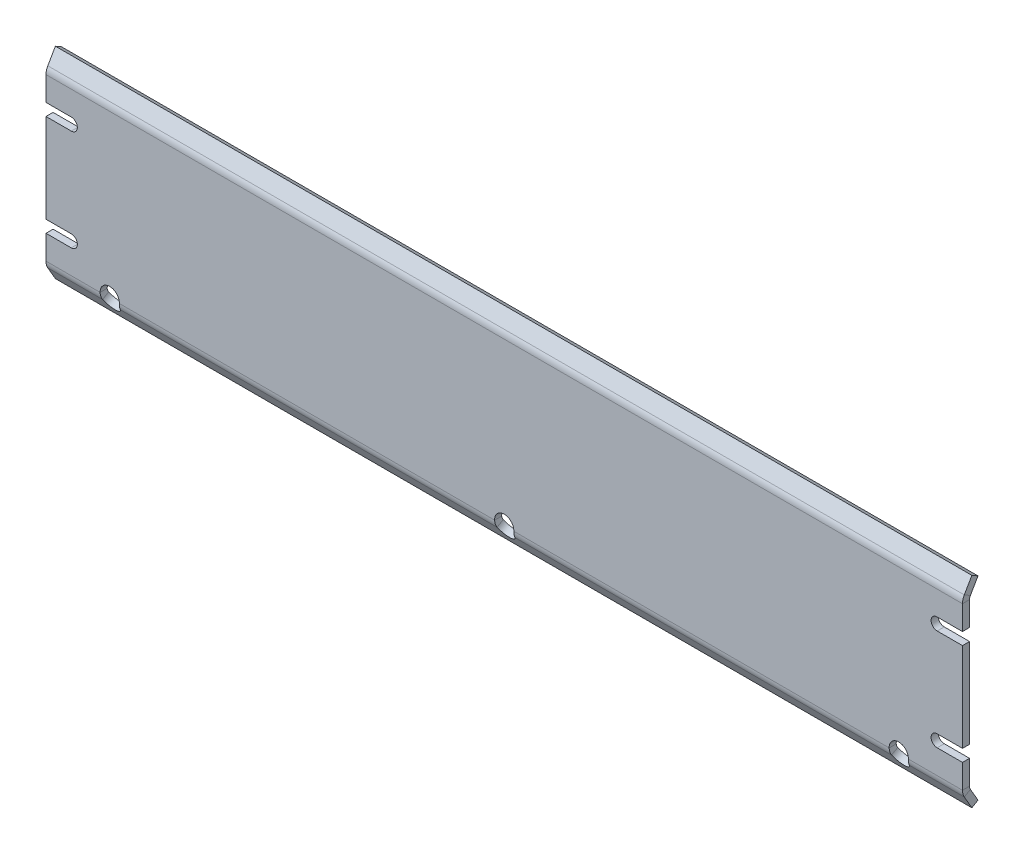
ISO-10303-21;
HEADER;
FILE_DESCRIPTION(('STEP AP214'),'2;1');
FILE_NAME('part.step','',(''),(''),'','','');
FILE_SCHEMA(('AUTOMOTIVE_DESIGN { 1 0 10303 214 1 1 1 1 }'));
ENDSEC;
DATA;
#1=APPLICATION_CONTEXT('core data for automotive mechanical design processes');
#2=APPLICATION_PROTOCOL_DEFINITION('international standard','automotive_design',2000,#1);
#3=PRODUCT_CONTEXT('',#1,'mechanical');
#4=PRODUCT('Part','Part','',(#3));
#5=PRODUCT_RELATED_PRODUCT_CATEGORY('part','',(#4));
#6=PRODUCT_DEFINITION_FORMATION('','',#4);
#7=PRODUCT_DEFINITION_CONTEXT('part definition',#1,'design');
#8=PRODUCT_DEFINITION('design','',#6,#7);
#9=PRODUCT_DEFINITION_SHAPE('','',#8);
#10=(LENGTH_UNIT() NAMED_UNIT(*) SI_UNIT(.MILLI.,.METRE.));
#11=(NAMED_UNIT(*) PLANE_ANGLE_UNIT() SI_UNIT($,.RADIAN.));
#12=(NAMED_UNIT(*) SI_UNIT($,.STERADIAN.) SOLID_ANGLE_UNIT());
#13=UNCERTAINTY_MEASURE_WITH_UNIT(LENGTH_MEASURE(1.E-05),#10,'distance_accuracy_value','');
#14=(GEOMETRIC_REPRESENTATION_CONTEXT(3) GLOBAL_UNCERTAINTY_ASSIGNED_CONTEXT((#13)) GLOBAL_UNIT_ASSIGNED_CONTEXT((#10,
#11,#12)) REPRESENTATION_CONTEXT('',''));
#15=CARTESIAN_POINT('',(0.,0.,0.));
#16=DIRECTION('',(0.,0.,1.));
#17=DIRECTION('',(1.,0.,0.));
#18=AXIS2_PLACEMENT_3D('',#15,#16,#17);
#19=CARTESIAN_POINT('',(230.124,-20.7104934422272,0.));
#20=DIRECTION('',(0.,-0.500000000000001,0.866025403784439));
#21=DIRECTION('',(0.,-0.866025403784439,-0.500000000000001));
#22=AXIS2_PLACEMENT_3D('',#19,#20,#21);
#23=PLANE('',#22);
#24=CARTESIAN_POINT('',(115.062,-20.193,0.298774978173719));
#25=DIRECTION('',(0.,-0.500000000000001,0.866025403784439));
#26=DIRECTION('',(0.,0.866025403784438,0.500000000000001));
#27=AXIS2_PLACEMENT_3D('',#24,#25,#26);
#28=ELLIPSE('',#27,2.78629239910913,2.413);
#29=CARTESIAN_POINT('',(112.818661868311,-21.0818211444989,-0.214386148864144));
#30=VERTEX_POINT('',#29);
#31=CARTESIAN_POINT('',(117.305338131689,-21.0818211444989,-0.214386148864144));
#32=VERTEX_POINT('',#31);
#33=EDGE_CURVE('E305',#30,#32,#28,.T.);
#34=ORIENTED_EDGE('',*,*,#33,.T.);
#35=DIRECTION('',(1.,0.,0.));
#36=VECTOR('',#35,1.);
#37=CARTESIAN_POINT('',(230.124,-21.0818211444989,-0.214386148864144));
#38=LINE('',#37,#36);
#39=CARTESIAN_POINT('',(211.878661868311,-21.0818211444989,-0.214386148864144));
#40=VERTEX_POINT('',#39);
#41=EDGE_CURVE('E349',#32,#40,#38,.T.);
#42=ORIENTED_EDGE('',*,*,#41,.T.);
#43=CARTESIAN_POINT('',(214.122,-20.193,0.298774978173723));
#44=DIRECTION('',(0.,-0.500000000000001,0.866025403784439));
#45=DIRECTION('',(0.,0.866025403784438,0.500000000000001));
#46=AXIS2_PLACEMENT_3D('',#43,#44,#45);
#47=ELLIPSE('',#46,2.78629239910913,2.413);
#48=CARTESIAN_POINT('',(216.365338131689,-21.0818211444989,-0.214386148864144));
#49=VERTEX_POINT('',#48);
#50=EDGE_CURVE('E1292',#40,#49,#47,.T.);
#51=ORIENTED_EDGE('',*,*,#50,.T.);
#52=CARTESIAN_POINT('',(230.124,-21.0818211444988,-0.21438614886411));
#53=VERTEX_POINT('',#52);
#54=EDGE_CURVE('E344',#49,#53,#38,.T.);
#55=ORIENTED_EDGE('',*,*,#54,.T.);
#56=DIRECTION('',(0.,0.866025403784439,0.500000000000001));
#57=VECTOR('',#56,1.);
#58=CARTESIAN_POINT('',(230.124,-20.7104934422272,0.));
#59=LINE('',#58,#57);
#60=CARTESIAN_POINT('',(230.124,-24.384,-2.1209));
#61=VERTEX_POINT('',#60);
#62=EDGE_CURVE('E334',#61,#53,#59,.T.);
#63=ORIENTED_EDGE('',*,*,#62,.F.);
#64=DIRECTION('',(-1.,0.,0.));
#65=VECTOR('',#64,1.);
#66=CARTESIAN_POINT('',(230.124,-24.384,-2.1209));
#67=LINE('',#66,#65);
#68=CARTESIAN_POINT('',(0.,-24.384,-2.12090000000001));
#69=VERTEX_POINT('',#68);
#70=EDGE_CURVE('E340',#61,#69,#67,.T.);
#71=ORIENTED_EDGE('',*,*,#70,.T.);
#72=DIRECTION('',(0.,0.866025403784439,0.500000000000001));
#73=VECTOR('',#72,1.);
#74=CARTESIAN_POINT('',(0.,-20.7104934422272,0.));
#75=LINE('',#74,#73);
#76=CARTESIAN_POINT('',(0.,-21.0818211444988,-0.21438614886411));
#77=VERTEX_POINT('',#76);
#78=EDGE_CURVE('E330',#69,#77,#75,.T.);
#79=ORIENTED_EDGE('',*,*,#78,.T.);
#80=CARTESIAN_POINT('',(13.7586618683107,-21.0818211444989,-0.214386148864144));
#81=VERTEX_POINT('',#80);
#82=EDGE_CURVE('E345',#77,#81,#38,.T.);
#83=ORIENTED_EDGE('',*,*,#82,.T.);
#84=CARTESIAN_POINT('',(16.0020000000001,-20.193,0.298774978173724));
#85=DIRECTION('',(0.,-0.500000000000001,0.866025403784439));
#86=DIRECTION('',(0.,0.866025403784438,0.500000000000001));
#87=AXIS2_PLACEMENT_3D('',#84,#85,#86);
#88=ELLIPSE('',#87,2.78629239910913,2.413);
#89=CARTESIAN_POINT('',(18.2453381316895,-21.0818211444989,-0.214386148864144));
#90=VERTEX_POINT('',#89);
#91=EDGE_CURVE('E1423',#81,#90,#88,.T.);
#92=ORIENTED_EDGE('',*,*,#91,.T.);
#93=EDGE_CURVE('E348',#90,#30,#38,.T.);
#94=ORIENTED_EDGE('',*,*,#93,.T.);
#95=EDGE_LOOP('',(#34,#42,#51,#55,#63,#71,#79,#83,#92,#94));
#96=FACE_BOUND('',#95,.T.);
#97=ADVANCED_FACE('F32',(#96),#23,.F.);
#98=CARTESIAN_POINT('',(230.124,-21.1869071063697,1.778));
#99=DIRECTION('',(0.,0.500000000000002,-0.866025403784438));
#100=DIRECTION('',(0.,0.866025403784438,0.500000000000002));
#101=AXIS2_PLACEMENT_3D('',#98,#99,#100);
#102=PLANE('',#101);
#103=CARTESIAN_POINT('',(115.062,-21.082,1.83856814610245));
#104=DIRECTION('',(0.,-0.500000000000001,0.866025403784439));
#105=DIRECTION('',(0.,0.866025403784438,0.500000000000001));
#106=AXIS2_PLACEMENT_3D('',#103,#104,#105);
#107=ELLIPSE('',#106,2.78629239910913,2.413);
#108=CARTESIAN_POINT('',(112.81866186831,-21.9708211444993,1.3254070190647));
#109=VERTEX_POINT('',#108);
#110=CARTESIAN_POINT('',(117.305338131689,-21.9708211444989,1.32540701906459));
#111=VERTEX_POINT('',#110);
#112=EDGE_CURVE('E302',#109,#111,#107,.T.);
#113=ORIENTED_EDGE('',*,*,#112,.F.);
#114=DIRECTION('',(-1.,0.,0.));
#115=VECTOR('',#114,1.);
#116=CARTESIAN_POINT('',(230.124,-21.9708211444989,1.32540701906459));
#117=LINE('',#116,#115);
#118=CARTESIAN_POINT('',(18.245338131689,-21.9708211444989,1.32540701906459));
#119=VERTEX_POINT('',#118);
#120=EDGE_CURVE('E313',#109,#119,#117,.T.);
#121=ORIENTED_EDGE('',*,*,#120,.T.);
#122=CARTESIAN_POINT('',(16.0020000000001,-21.082,1.83856814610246));
#123=DIRECTION('',(0.,-0.500000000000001,0.866025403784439));
#124=DIRECTION('',(0.,0.866025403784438,0.500000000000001));
#125=AXIS2_PLACEMENT_3D('',#122,#123,#124);
#126=ELLIPSE('',#125,2.78629239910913,2.413);
#127=CARTESIAN_POINT('',(13.7586618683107,-21.9708211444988,1.32540701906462));
#128=VERTEX_POINT('',#127);
#129=EDGE_CURVE('E1068',#128,#119,#126,.T.);
#130=ORIENTED_EDGE('',*,*,#129,.F.);
#131=CARTESIAN_POINT('',(0.,-21.9708211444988,1.32540701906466));
#132=VERTEX_POINT('',#131);
#133=EDGE_CURVE('E323',#128,#132,#117,.T.);
#134=ORIENTED_EDGE('',*,*,#133,.T.);
#135=DIRECTION('',(0.,0.866025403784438,0.500000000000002));
#136=VECTOR('',#135,1.);
#137=CARTESIAN_POINT('',(0.,-21.5994934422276,1.53979316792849));
#138=LINE('',#137,#136);
#139=CARTESIAN_POINT('',(0.,-25.273,-0.581106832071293));
#140=VERTEX_POINT('',#139);
#141=EDGE_CURVE('E361',#140,#132,#138,.T.);
#142=ORIENTED_EDGE('',*,*,#141,.F.);
#143=DIRECTION('',(-1.,0.,0.));
#144=VECTOR('',#143,1.);
#145=CARTESIAN_POINT('',(230.124,-25.273,-0.581106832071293));
#146=LINE('',#145,#144);
#147=CARTESIAN_POINT('',(230.124,-25.273,-0.581106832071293));
#148=VERTEX_POINT('',#147);
#149=EDGE_CURVE('E1251',#148,#140,#146,.T.);
#150=ORIENTED_EDGE('',*,*,#149,.F.);
#151=DIRECTION('',(0.,-0.866025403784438,-0.500000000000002));
#152=VECTOR('',#151,1.);
#153=CARTESIAN_POINT('',(230.124,-21.1869071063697,1.778));
#154=LINE('',#153,#152);
#155=CARTESIAN_POINT('',(230.124,-21.9708211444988,1.32540701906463));
#156=VERTEX_POINT('',#155);
#157=EDGE_CURVE('E326',#156,#148,#154,.T.);
#158=ORIENTED_EDGE('',*,*,#157,.F.);
#159=CARTESIAN_POINT('',(216.365338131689,-21.9708211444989,1.32540701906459));
#160=VERTEX_POINT('',#159);
#161=EDGE_CURVE('E325',#156,#160,#117,.T.);
#162=ORIENTED_EDGE('',*,*,#161,.T.);
#163=CARTESIAN_POINT('',(214.122,-21.082,1.83856814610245));
#164=DIRECTION('',(0.,-0.500000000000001,0.866025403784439));
#165=DIRECTION('',(0.,0.866025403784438,0.500000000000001));
#166=AXIS2_PLACEMENT_3D('',#163,#164,#165);
#167=ELLIPSE('',#166,2.78629239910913,2.413);
#168=CARTESIAN_POINT('',(211.878661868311,-21.9708211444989,1.32540701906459));
#169=VERTEX_POINT('',#168);
#170=EDGE_CURVE('E1471',#169,#160,#167,.T.);
#171=ORIENTED_EDGE('',*,*,#170,.F.);
#172=EDGE_CURVE('E317',#169,#111,#117,.T.);
#173=ORIENTED_EDGE('',*,*,#172,.T.);
#174=EDGE_LOOP('',(#113,#121,#130,#134,#142,#150,#158,#162,#171,#173));
#175=FACE_BOUND('',#174,.T.);
#176=ADVANCED_FACE('F311',(#175),#102,.F.);
#177=CARTESIAN_POINT('',(230.124,-20.7104934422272,0.));
#178=DIRECTION('',(0.,0.,1.));
#179=DIRECTION('',(0.,-1.,0.));
#180=AXIS2_PLACEMENT_3D('',#177,#178,#179);
#181=PLANE('',#180);
#182=CARTESIAN_POINT('',(115.062,-20.193,0.));
#183=DIRECTION('',(0.,0.,-1.));
#184=DIRECTION('',(0.,1.,0.));
#185=AXIS2_PLACEMENT_3D('',#182,#183,#184);
#186=CIRCLE('',#185,2.413);
#187=CARTESIAN_POINT('',(112.650631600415,-20.2817211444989,0.));
#188=VERTEX_POINT('',#187);
#189=CARTESIAN_POINT('',(117.473368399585,-20.2817211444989,0.));
#190=VERTEX_POINT('',#189);
#191=EDGE_CURVE('E1276',#188,#190,#186,.T.);
#192=ORIENTED_EDGE('',*,*,#191,.F.);
#193=DIRECTION('',(1.,0.,0.));
#194=VECTOR('',#193,1.);
#195=CARTESIAN_POINT('',(230.124,-20.2817211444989,0.));
#196=LINE('',#195,#194);
#197=CARTESIAN_POINT('',(18.4133683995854,-20.2817211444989,0.));
#198=VERTEX_POINT('',#197);
#199=EDGE_CURVE('E1246',#198,#188,#196,.T.);
#200=ORIENTED_EDGE('',*,*,#199,.F.);
#201=CARTESIAN_POINT('',(16.0020000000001,-20.193,0.));
#202=DIRECTION('',(0.,0.,1.));
#203=DIRECTION('',(1.,0.,0.));
#204=AXIS2_PLACEMENT_3D('',#201,#202,#203);
#205=CIRCLE('',#204,2.413);
#206=CARTESIAN_POINT('',(13.5906316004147,-20.2817211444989,0.));
#207=VERTEX_POINT('',#206);
#208=EDGE_CURVE('E1078',#198,#207,#205,.T.);
#209=ORIENTED_EDGE('',*,*,#208,.T.);
#210=CARTESIAN_POINT('',(0.,-20.2817211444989,0.));
#211=VERTEX_POINT('',#210);
#212=EDGE_CURVE('E1242',#211,#207,#196,.T.);
#213=ORIENTED_EDGE('',*,*,#212,.F.);
#214=DIRECTION('',(0.,1.,0.));
#215=VECTOR('',#214,1.);
#216=CARTESIAN_POINT('',(0.,-20.7104934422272,0.));
#217=LINE('',#216,#215);
#218=CARTESIAN_POINT('',(0.,-14.224,0.));
#219=VERTEX_POINT('',#218);
#220=EDGE_CURVE('E1222',#211,#219,#217,.T.);
#221=ORIENTED_EDGE('',*,*,#220,.T.);
#222=DIRECTION('',(1.,0.,0.));
#223=VECTOR('',#222,1.);
#224=CARTESIAN_POINT('',(0.,-14.224,0.));
#225=LINE('',#224,#223);
#226=CARTESIAN_POINT('',(6.35,-14.224,0.));
#227=VERTEX_POINT('',#226);
#228=EDGE_CURVE('E1170',#219,#227,#225,.T.);
#229=ORIENTED_EDGE('',*,*,#228,.T.);
#230=CARTESIAN_POINT('',(6.35,-12.7,0.));
#231=DIRECTION('',(0.,0.,1.));
#232=DIRECTION('',(1.,0.,0.));
#233=AXIS2_PLACEMENT_3D('',#230,#231,#232);
#234=CIRCLE('',#233,1.524);
#235=CARTESIAN_POINT('',(6.35,-11.176,0.));
#236=VERTEX_POINT('',#235);
#237=EDGE_CURVE('E1164',#227,#236,#234,.T.);
#238=ORIENTED_EDGE('',*,*,#237,.T.);
#239=DIRECTION('',(-1.,0.,0.));
#240=VECTOR('',#239,1.);
#241=CARTESIAN_POINT('',(0.,-11.176,0.));
#242=LINE('',#241,#240);
#243=CARTESIAN_POINT('',(0.,-11.176,0.));
#244=VERTEX_POINT('',#243);
#245=EDGE_CURVE('E1167',#236,#244,#242,.T.);
#246=ORIENTED_EDGE('',*,*,#245,.T.);
#247=CARTESIAN_POINT('',(0.,11.176,0.));
#248=VERTEX_POINT('',#247);
#249=EDGE_CURVE('E1226',#244,#248,#217,.T.);
#250=ORIENTED_EDGE('',*,*,#249,.T.);
#251=DIRECTION('',(1.,0.,0.));
#252=VECTOR('',#251,1.);
#253=CARTESIAN_POINT('',(0.,11.176,0.));
#254=LINE('',#253,#252);
#255=CARTESIAN_POINT('',(6.35,11.176,0.));
#256=VERTEX_POINT('',#255);
#257=EDGE_CURVE('E1191',#248,#256,#254,.T.);
#258=ORIENTED_EDGE('',*,*,#257,.T.);
#259=CARTESIAN_POINT('',(6.35,12.7,0.));
#260=DIRECTION('',(0.,0.,1.));
#261=DIRECTION('',(-1.,0.,0.));
#262=AXIS2_PLACEMENT_3D('',#259,#260,#261);
#263=CIRCLE('',#262,1.524);
#264=CARTESIAN_POINT('',(6.35,14.224,0.));
#265=VERTEX_POINT('',#264);
#266=EDGE_CURVE('E1194',#256,#265,#263,.T.);
#267=ORIENTED_EDGE('',*,*,#266,.T.);
#268=DIRECTION('',(-1.,0.,0.));
#269=VECTOR('',#268,1.);
#270=CARTESIAN_POINT('',(0.,14.224,0.));
#271=LINE('',#270,#269);
#272=CARTESIAN_POINT('',(0.,14.224,0.));
#273=VERTEX_POINT('',#272);
#274=EDGE_CURVE('E1197',#265,#273,#271,.T.);
#275=ORIENTED_EDGE('',*,*,#274,.T.);
#276=CARTESIAN_POINT('',(0.,20.2817211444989,0.));
#277=VERTEX_POINT('',#276);
#278=EDGE_CURVE('E1221',#273,#277,#217,.T.);
#279=ORIENTED_EDGE('',*,*,#278,.T.);
#280=DIRECTION('',(-1.,0.,0.));
#281=VECTOR('',#280,1.);
#282=CARTESIAN_POINT('',(0.,20.2817211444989,0.));
#283=LINE('',#282,#281);
#284=CARTESIAN_POINT('',(230.124,20.281721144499,0.));
#285=VERTEX_POINT('',#284);
#286=EDGE_CURVE('E1230',#285,#277,#283,.T.);
#287=ORIENTED_EDGE('',*,*,#286,.F.);
#288=DIRECTION('',(0.,1.,0.));
#289=VECTOR('',#288,1.);
#290=CARTESIAN_POINT('',(230.124,-20.7104934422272,0.));
#291=LINE('',#290,#289);
#292=CARTESIAN_POINT('',(230.124,14.224,0.));
#293=VERTEX_POINT('',#292);
#294=EDGE_CURVE('E1225',#293,#285,#291,.T.);
#295=ORIENTED_EDGE('',*,*,#294,.F.);
#296=DIRECTION('',(-1.,0.,0.));
#297=VECTOR('',#296,1.);
#298=CARTESIAN_POINT('',(230.124,14.224,0.));
#299=LINE('',#298,#297);
#300=CARTESIAN_POINT('',(223.774,14.224,0.));
#301=VERTEX_POINT('',#300);
#302=EDGE_CURVE('E1117',#293,#301,#299,.T.);
#303=ORIENTED_EDGE('',*,*,#302,.T.);
#304=CARTESIAN_POINT('',(223.774,12.7,0.));
#305=DIRECTION('',(0.,0.,1.));
#306=DIRECTION('',(1.,0.,0.));
#307=AXIS2_PLACEMENT_3D('',#304,#305,#306);
#308=CIRCLE('',#307,1.524);
#309=CARTESIAN_POINT('',(223.774,11.176,0.));
#310=VERTEX_POINT('',#309);
#311=EDGE_CURVE('E1111',#301,#310,#308,.T.);
#312=ORIENTED_EDGE('',*,*,#311,.T.);
#313=DIRECTION('',(1.,0.,0.));
#314=VECTOR('',#313,1.);
#315=CARTESIAN_POINT('',(230.124,11.176,0.));
#316=LINE('',#315,#314);
#317=CARTESIAN_POINT('',(230.124,11.176,0.));
#318=VERTEX_POINT('',#317);
#319=EDGE_CURVE('E1114',#310,#318,#316,.T.);
#320=ORIENTED_EDGE('',*,*,#319,.T.);
#321=CARTESIAN_POINT('',(230.124,-11.176,0.));
#322=VERTEX_POINT('',#321);
#323=EDGE_CURVE('E1231',#322,#318,#291,.T.);
#324=ORIENTED_EDGE('',*,*,#323,.F.);
#325=DIRECTION('',(-1.,0.,0.));
#326=VECTOR('',#325,1.);
#327=CARTESIAN_POINT('',(230.124,-11.176,0.));
#328=LINE('',#327,#326);
#329=CARTESIAN_POINT('',(223.774,-11.176,0.));
#330=VERTEX_POINT('',#329);
#331=EDGE_CURVE('E1143',#322,#330,#328,.T.);
#332=ORIENTED_EDGE('',*,*,#331,.T.);
#333=CARTESIAN_POINT('',(223.774,-12.7,0.));
#334=DIRECTION('',(0.,0.,1.));
#335=DIRECTION('',(-1.,0.,0.));
#336=AXIS2_PLACEMENT_3D('',#333,#334,#335);
#337=CIRCLE('',#336,1.524);
#338=CARTESIAN_POINT('',(223.774,-14.224,0.));
#339=VERTEX_POINT('',#338);
#340=EDGE_CURVE('E1137',#330,#339,#337,.T.);
#341=ORIENTED_EDGE('',*,*,#340,.T.);
#342=DIRECTION('',(1.,0.,0.));
#343=VECTOR('',#342,1.);
#344=CARTESIAN_POINT('',(230.124,-14.224,0.));
#345=LINE('',#344,#343);
#346=CARTESIAN_POINT('',(230.124,-14.224,0.));
#347=VERTEX_POINT('',#346);
#348=EDGE_CURVE('E1140',#339,#347,#345,.T.);
#349=ORIENTED_EDGE('',*,*,#348,.T.);
#350=CARTESIAN_POINT('',(230.124,-20.2817211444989,0.));
#351=VERTEX_POINT('',#350);
#352=EDGE_CURVE('E1227',#351,#347,#291,.T.);
#353=ORIENTED_EDGE('',*,*,#352,.F.);
#354=CARTESIAN_POINT('',(216.533368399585,-20.2817211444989,0.));
#355=VERTEX_POINT('',#354);
#356=EDGE_CURVE('E1241',#355,#351,#196,.T.);
#357=ORIENTED_EDGE('',*,*,#356,.F.);
#358=CARTESIAN_POINT('',(214.122,-20.193,0.));
#359=DIRECTION('',(0.,0.,1.));
#360=DIRECTION('',(1.,0.,0.));
#361=AXIS2_PLACEMENT_3D('',#358,#359,#360);
#362=CIRCLE('',#361,2.413);
#363=CARTESIAN_POINT('',(211.710631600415,-20.2817211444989,0.));
#364=VERTEX_POINT('',#363);
#365=EDGE_CURVE('E1463',#355,#364,#362,.T.);
#366=ORIENTED_EDGE('',*,*,#365,.T.);
#367=EDGE_CURVE('E1247',#190,#364,#196,.T.);
#368=ORIENTED_EDGE('',*,*,#367,.F.);
#369=EDGE_LOOP('',(#192,#200,#209,#213,#221,#229,#238,#246,#250,#258,#267,#275,#279,#287,#295,
#303,#312,#320,#324,#332,#341,#349,#353,#357,#366,#368));
#370=FACE_BOUND('',#369,.T.);
#371=ADVANCED_FACE('F438',(#370),#181,.F.);
#372=CARTESIAN_POINT('',(230.124,-21.1869071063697,1.778));
#373=DIRECTION('',(0.,0.,-1.));
#374=DIRECTION('',(0.,1.,0.));
#375=AXIS2_PLACEMENT_3D('',#372,#373,#374);
#376=PLANE('',#375);
#377=CARTESIAN_POINT('',(115.062,-20.193,1.778));
#378=DIRECTION('',(0.,0.,-1.));
#379=DIRECTION('',(0.,1.,0.));
#380=AXIS2_PLACEMENT_3D('',#377,#378,#379);
#381=CIRCLE('',#380,2.413);
#382=CARTESIAN_POINT('',(112.650631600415,-20.2817211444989,1.778));
#383=VERTEX_POINT('',#382);
#384=CARTESIAN_POINT('',(117.473368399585,-20.2817211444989,1.778));
#385=VERTEX_POINT('',#384);
#386=EDGE_CURVE('E47',#383,#385,#381,.T.);
#387=ORIENTED_EDGE('',*,*,#386,.T.);
#388=DIRECTION('',(-1.,0.,0.));
#389=VECTOR('',#388,1.);
#390=CARTESIAN_POINT('',(230.124,-20.2817211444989,1.778));
#391=LINE('',#390,#389);
#392=CARTESIAN_POINT('',(211.710631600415,-20.2817211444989,1.778));
#393=VERTEX_POINT('',#392);
#394=EDGE_CURVE('E1252',#393,#385,#391,.T.);
#395=ORIENTED_EDGE('',*,*,#394,.F.);
#396=CARTESIAN_POINT('',(214.122,-20.193,1.778));
#397=DIRECTION('',(0.,0.,1.));
#398=DIRECTION('',(-1.,0.,0.));
#399=AXIS2_PLACEMENT_3D('',#396,#397,#398);
#400=CIRCLE('',#399,2.413);
#401=CARTESIAN_POINT('',(216.533368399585,-20.2817211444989,1.778));
#402=VERTEX_POINT('',#401);
#403=EDGE_CURVE('E1275',#402,#393,#400,.T.);
#404=ORIENTED_EDGE('',*,*,#403,.F.);
#405=CARTESIAN_POINT('',(230.124,-20.2817211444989,1.778));
#406=VERTEX_POINT('',#405);
#407=EDGE_CURVE('E1248',#406,#402,#391,.T.);
#408=ORIENTED_EDGE('',*,*,#407,.F.);
#409=DIRECTION('',(0.,-1.,0.));
#410=VECTOR('',#409,1.);
#411=CARTESIAN_POINT('',(230.124,-21.1869071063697,1.778));
#412=LINE('',#411,#410);
#413=CARTESIAN_POINT('',(230.124,-14.224,1.778));
#414=VERTEX_POINT('',#413);
#415=EDGE_CURVE('E1213',#414,#406,#412,.T.);
#416=ORIENTED_EDGE('',*,*,#415,.F.);
#417=DIRECTION('',(1.,0.,0.));
#418=VECTOR('',#417,1.);
#419=CARTESIAN_POINT('',(230.124,-14.224,1.778));
#420=LINE('',#419,#418);
#421=CARTESIAN_POINT('',(223.774,-14.224,1.778));
#422=VERTEX_POINT('',#421);
#423=EDGE_CURVE('E1132',#422,#414,#420,.T.);
#424=ORIENTED_EDGE('',*,*,#423,.F.);
#425=CARTESIAN_POINT('',(223.774,-12.7,1.778));
#426=DIRECTION('',(0.,0.,1.));
#427=DIRECTION('',(-1.,0.,0.));
#428=AXIS2_PLACEMENT_3D('',#425,#426,#427);
#429=CIRCLE('',#428,1.524);
#430=CARTESIAN_POINT('',(223.774,-11.176,1.778));
#431=VERTEX_POINT('',#430);
#432=EDGE_CURVE('E1123',#431,#422,#429,.T.);
#433=ORIENTED_EDGE('',*,*,#432,.F.);
#434=DIRECTION('',(-1.,0.,0.));
#435=VECTOR('',#434,1.);
#436=CARTESIAN_POINT('',(230.124,-11.176,1.778));
#437=LINE('',#436,#435);
#438=CARTESIAN_POINT('',(230.124,-11.176,1.778));
#439=VERTEX_POINT('',#438);
#440=EDGE_CURVE('E1134',#439,#431,#437,.T.);
#441=ORIENTED_EDGE('',*,*,#440,.F.);
#442=CARTESIAN_POINT('',(230.124,11.176,1.778));
#443=VERTEX_POINT('',#442);
#444=EDGE_CURVE('E1219',#443,#439,#412,.T.);
#445=ORIENTED_EDGE('',*,*,#444,.F.);
#446=DIRECTION('',(1.,0.,0.));
#447=VECTOR('',#446,1.);
#448=CARTESIAN_POINT('',(230.124,11.176,1.778));
#449=LINE('',#448,#447);
#450=CARTESIAN_POINT('',(223.774,11.176,1.778));
#451=VERTEX_POINT('',#450);
#452=EDGE_CURVE('E1106',#451,#443,#449,.T.);
#453=ORIENTED_EDGE('',*,*,#452,.F.);
#454=CARTESIAN_POINT('',(223.774,12.7,1.778));
#455=DIRECTION('',(0.,0.,1.));
#456=DIRECTION('',(1.,0.,0.));
#457=AXIS2_PLACEMENT_3D('',#454,#455,#456);
#458=CIRCLE('',#457,1.524);
#459=CARTESIAN_POINT('',(223.774,14.224,1.778));
#460=VERTEX_POINT('',#459);
#461=EDGE_CURVE('E1104',#460,#451,#458,.T.);
#462=ORIENTED_EDGE('',*,*,#461,.F.);
#463=DIRECTION('',(-1.,0.,0.));
#464=VECTOR('',#463,1.);
#465=CARTESIAN_POINT('',(230.124,14.224,1.778));
#466=LINE('',#465,#464);
#467=CARTESIAN_POINT('',(230.124,14.224,1.778));
#468=VERTEX_POINT('',#467);
#469=EDGE_CURVE('E1108',#468,#460,#466,.T.);
#470=ORIENTED_EDGE('',*,*,#469,.F.);
#471=CARTESIAN_POINT('',(230.124,20.281721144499,1.778));
#472=VERTEX_POINT('',#471);
#473=EDGE_CURVE('E1215',#472,#468,#412,.T.);
#474=ORIENTED_EDGE('',*,*,#473,.F.);
#475=DIRECTION('',(1.,0.,0.));
#476=VECTOR('',#475,1.);
#477=CARTESIAN_POINT('',(0.,20.2817211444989,1.778));
#478=LINE('',#477,#476);
#479=CARTESIAN_POINT('',(0.,20.2817211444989,1.77799999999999));
#480=VERTEX_POINT('',#479);
#481=EDGE_CURVE('E1218',#480,#472,#478,.T.);
#482=ORIENTED_EDGE('',*,*,#481,.F.);
#483=DIRECTION('',(0.,-1.,0.));
#484=VECTOR('',#483,1.);
#485=CARTESIAN_POINT('',(0.,-21.1869071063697,1.778));
#486=LINE('',#485,#484);
#487=CARTESIAN_POINT('',(0.,14.224,1.778));
#488=VERTEX_POINT('',#487);
#489=EDGE_CURVE('E1210',#480,#488,#486,.T.);
#490=ORIENTED_EDGE('',*,*,#489,.T.);
#491=DIRECTION('',(-1.,0.,0.));
#492=VECTOR('',#491,1.);
#493=CARTESIAN_POINT('',(0.,14.224,1.778));
#494=LINE('',#493,#492);
#495=CARTESIAN_POINT('',(6.35,14.224,1.778));
#496=VERTEX_POINT('',#495);
#497=EDGE_CURVE('E1189',#496,#488,#494,.T.);
#498=ORIENTED_EDGE('',*,*,#497,.F.);
#499=CARTESIAN_POINT('',(6.35,12.7,1.778));
#500=DIRECTION('',(0.,0.,1.));
#501=DIRECTION('',(-1.,0.,0.));
#502=AXIS2_PLACEMENT_3D('',#499,#500,#501);
#503=CIRCLE('',#502,1.524);
#504=CARTESIAN_POINT('',(6.35,11.176,1.778));
#505=VERTEX_POINT('',#504);
#506=EDGE_CURVE('E1186',#505,#496,#503,.T.);
#507=ORIENTED_EDGE('',*,*,#506,.F.);
#508=DIRECTION('',(1.,0.,0.));
#509=VECTOR('',#508,1.);
#510=CARTESIAN_POINT('',(0.,11.176,1.778));
#511=LINE('',#510,#509);
#512=CARTESIAN_POINT('',(0.,11.176,1.778));
#513=VERTEX_POINT('',#512);
#514=EDGE_CURVE('E1176',#513,#505,#511,.T.);
#515=ORIENTED_EDGE('',*,*,#514,.F.);
#516=CARTESIAN_POINT('',(0.,-11.176,1.778));
#517=VERTEX_POINT('',#516);
#518=EDGE_CURVE('E1214',#513,#517,#486,.T.);
#519=ORIENTED_EDGE('',*,*,#518,.T.);
#520=DIRECTION('',(-1.,0.,0.));
#521=VECTOR('',#520,1.);
#522=CARTESIAN_POINT('',(0.,-11.176,1.778));
#523=LINE('',#522,#521);
#524=CARTESIAN_POINT('',(6.34999999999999,-11.176,1.778));
#525=VERTEX_POINT('',#524);
#526=EDGE_CURVE('E1159',#525,#517,#523,.T.);
#527=ORIENTED_EDGE('',*,*,#526,.F.);
#528=CARTESIAN_POINT('',(6.35,-12.7,1.778));
#529=DIRECTION('',(0.,0.,1.));
#530=DIRECTION('',(1.,0.,0.));
#531=AXIS2_PLACEMENT_3D('',#528,#529,#530);
#532=CIRCLE('',#531,1.524);
#533=CARTESIAN_POINT('',(6.35,-14.224,1.778));
#534=VERTEX_POINT('',#533);
#535=EDGE_CURVE('E1149',#534,#525,#532,.T.);
#536=ORIENTED_EDGE('',*,*,#535,.F.);
#537=DIRECTION('',(1.,0.,0.));
#538=VECTOR('',#537,1.);
#539=CARTESIAN_POINT('',(0.,-14.224,1.778));
#540=LINE('',#539,#538);
#541=CARTESIAN_POINT('',(0.,-14.224,1.778));
#542=VERTEX_POINT('',#541);
#543=EDGE_CURVE('E1161',#542,#534,#540,.T.);
#544=ORIENTED_EDGE('',*,*,#543,.F.);
#545=CARTESIAN_POINT('',(0.,-20.2817211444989,1.778));
#546=VERTEX_POINT('',#545);
#547=EDGE_CURVE('E1204',#542,#546,#486,.T.);
#548=ORIENTED_EDGE('',*,*,#547,.T.);
#549=CARTESIAN_POINT('',(13.5906316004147,-20.2817211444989,1.778));
#550=VERTEX_POINT('',#549);
#551=EDGE_CURVE('E1245',#550,#546,#391,.T.);
#552=ORIENTED_EDGE('',*,*,#551,.F.);
#553=CARTESIAN_POINT('',(16.0020000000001,-20.193,1.778));
#554=DIRECTION('',(0.,0.,1.));
#555=DIRECTION('',(1.,0.,0.));
#556=AXIS2_PLACEMENT_3D('',#553,#554,#555);
#557=CIRCLE('',#556,2.413);
#558=CARTESIAN_POINT('',(18.4133683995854,-20.2817211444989,1.778));
#559=VERTEX_POINT('',#558);
#560=EDGE_CURVE('E1073',#559,#550,#557,.T.);
#561=ORIENTED_EDGE('',*,*,#560,.F.);
#562=EDGE_CURVE('E1253',#383,#559,#391,.T.);
#563=ORIENTED_EDGE('',*,*,#562,.F.);
#564=EDGE_LOOP('',(#387,#395,#404,#408,#416,#424,#433,#441,#445,#453,#462,#470,#474,#482,#490,
#498,#507,#515,#519,#527,#536,#544,#548,#552,#561,#563));
#565=FACE_BOUND('',#564,.T.);
#566=ADVANCED_FACE('F818',(#565),#376,.F.);
#567=CARTESIAN_POINT('',(465.79425427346,-20.2817211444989,-1.6002));
#568=DIRECTION('',(-1.,0.,0.));
#569=DIRECTION('',(0.,0.,1.));
#570=AXIS2_PLACEMENT_3D('',#567,#568,#569);
#571=CYLINDRICAL_SURFACE('',#570,3.3782);
#572=ORIENTED_EDGE('',*,*,#394,.T.);
#573=CARTESIAN_POINT('',(117.305338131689,-21.9708211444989,1.32540701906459));
#574=CARTESIAN_POINT('',(117.31730675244,-21.9070463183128,1.36223110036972));
#575=CARTESIAN_POINT('',(117.328792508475,-21.841995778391,1.39700367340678));
#576=CARTESIAN_POINT('',(117.350691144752,-21.7096229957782,1.46227802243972));
#577=CARTESIAN_POINT('',(117.361104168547,-21.6423010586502,1.49278037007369));
#578=CARTESIAN_POINT('',(117.38075435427,-21.5056417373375,1.54935902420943));
#579=CARTESIAN_POINT('',(117.389991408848,-21.4363041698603,1.57543492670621));
#580=CARTESIAN_POINT('',(117.407156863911,-21.2959254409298,1.62301672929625));
#581=CARTESIAN_POINT('',(117.415085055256,-21.2248840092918,1.64452189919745));
#582=CARTESIAN_POINT('',(117.436543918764,-21.0118303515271,1.70139256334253));
#583=CARTESIAN_POINT('',(117.448065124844,-20.8677116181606,1.73001327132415));
#584=CARTESIAN_POINT('',(117.460914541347,-20.6493246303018,1.75874937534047));
#585=CARTESIAN_POINT('',(117.464461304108,-20.5760274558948,1.76596236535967));
#586=CARTESIAN_POINT('',(117.470047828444,-20.4290754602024,1.77558667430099));
#587=CARTESIAN_POINT('',(117.472087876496,-20.3554207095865,1.77799890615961));
#588=CARTESIAN_POINT('',(117.473368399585,-20.2817211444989,1.778));
#589=B_SPLINE_CURVE_WITH_KNOTS('',3,(#573,#574,#575,#576,#577,#578,#579,#580,#581,#582,#583,
#584,#585,#586,#587,#588),.UNSPECIFIED.,.F.,.F.,(4,2,2,2,2,2,2,4),(0.,0.223785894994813,
0.447541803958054,0.671318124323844,0.895130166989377,1.33567862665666,1.55674672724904,
1.77777278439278),.UNSPECIFIED.);
#590=EDGE_CURVE('E295',#111,#385,#589,.T.);
#591=ORIENTED_EDGE('',*,*,#590,.F.);
#592=ORIENTED_EDGE('',*,*,#172,.F.);
#593=CARTESIAN_POINT('',(211.710631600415,-20.2817211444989,1.778));
#594=CARTESIAN_POINT('',(211.711940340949,-20.3563382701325,1.77800084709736));
#595=CARTESIAN_POINT('',(211.714049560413,-20.4309166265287,1.77552682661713));
#596=CARTESIAN_POINT('',(211.719805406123,-20.5796853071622,1.76565972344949));
#597=CARTESIAN_POINT('',(211.723451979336,-20.6538756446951,1.75826681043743));
#598=CARTESIAN_POINT('',(211.736597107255,-20.875313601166,1.72876787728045));
#599=CARTESIAN_POINT('',(211.748302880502,-21.0215229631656,1.69934158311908));
#600=CARTESIAN_POINT('',(211.777126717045,-21.3050384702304,1.62255573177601));
#601=CARTESIAN_POINT('',(211.794118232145,-21.4424704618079,1.57561082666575));
#602=CARTESIAN_POINT('',(211.823140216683,-21.6439818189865,1.49203339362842));
#603=CARTESIAN_POINT('',(211.833512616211,-21.7109576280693,1.46164772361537));
#604=CARTESIAN_POINT('',(211.855317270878,-21.842644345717,1.39665560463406));
#605=CARTESIAN_POINT('',(211.866749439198,-21.9073554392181,1.36204950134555));
#606=CARTESIAN_POINT('',(211.878661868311,-21.9708211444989,1.32540701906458));
#607=B_SPLINE_CURVE_WITH_KNOTS('',3,(#593,#594,#595,#596,#597,#598,#599,#600,#601,#602,#603,
#604,#605,#606),.UNSPECIFIED.,.F.,.F.,(4,2,2,2,2,2,4),(0.,0.223792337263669,0.447576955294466,
0.894864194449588,1.33217444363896,1.55485445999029,1.77751624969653),.UNSPECIFIED.);
#608=EDGE_CURVE('E1272',#393,#169,#607,.T.);
#609=ORIENTED_EDGE('',*,*,#608,.F.);
#610=EDGE_LOOP('',(#572,#591,#592,#609));
#611=FACE_BOUND('',#610,.T.);
#612=ADVANCED_FACE('F829',(#611),#571,.T.);
#613=ORIENTED_EDGE('',*,*,#120,.F.);
#614=CARTESIAN_POINT('',(112.650631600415,-20.2817211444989,1.778));
#615=CARTESIAN_POINT('',(112.651926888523,-20.3563506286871,1.7780011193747));
#616=CARTESIAN_POINT('',(112.65400338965,-20.4309432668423,1.77552606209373));
#617=CARTESIAN_POINT('',(112.659700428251,-20.5797390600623,1.7656551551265));
#618=CARTESIAN_POINT('',(112.663320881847,-20.6539422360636,1.75825957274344));
#619=CARTESIAN_POINT('',(112.676465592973,-20.8754161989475,1.72875094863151));
#620=CARTESIAN_POINT('',(112.688274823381,-21.0216430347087,1.69931595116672));
#621=CARTESIAN_POINT('',(112.717177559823,-21.3051516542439,1.62251833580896));
#622=CARTESIAN_POINT('',(112.734145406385,-21.4425609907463,1.57557658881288));
#623=CARTESIAN_POINT('',(112.7631527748,-21.6440376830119,1.49200853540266));
#624=CARTESIAN_POINT('',(112.773523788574,-21.7110012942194,1.46162706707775));
#625=CARTESIAN_POINT('',(112.795325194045,-21.8426651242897,1.39664445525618));
#626=CARTESIAN_POINT('',(112.806755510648,-21.9073655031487,1.36204361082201));
#627=CARTESIAN_POINT('',(112.818661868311,-21.9708211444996,1.32540701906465));
#628=B_SPLINE_CURVE_WITH_KNOTS('',3,(#614,#615,#616,#617,#618,#619,#620,#621,#622,#623,#624,
#625,#626,#627),.UNSPECIFIED.,.F.,.F.,(4,2,2,2,2,2,4),(0.,0.223831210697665,0.447650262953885,
0.895015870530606,1.33225539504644,1.55489640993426,1.7775216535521),.UNSPECIFIED.);
#629=EDGE_CURVE('E289',#383,#109,#628,.T.);
#630=ORIENTED_EDGE('',*,*,#629,.F.);
#631=ORIENTED_EDGE('',*,*,#562,.T.);
#632=CARTESIAN_POINT('',(18.2453381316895,-21.9708211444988,1.32540701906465));
#633=CARTESIAN_POINT('',(18.257308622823,-21.9070526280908,1.36222721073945));
#634=CARTESIAN_POINT('',(18.2688101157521,-21.8420102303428,1.39699585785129));
#635=CARTESIAN_POINT('',(18.2907384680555,-21.7096542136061,1.46226331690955));
#636=CARTESIAN_POINT('',(18.3011654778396,-21.6423409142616,1.49276272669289));
#637=CARTESIAN_POINT('',(18.3208126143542,-21.5056949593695,1.54933813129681));
#638=CARTESIAN_POINT('',(18.3300326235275,-21.4363621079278,1.57541369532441));
#639=CARTESIAN_POINT('',(18.347172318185,-21.2959937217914,1.62299517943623));
#640=CARTESIAN_POINT('',(18.3550917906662,-21.2249579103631,1.64450035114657));
#641=CARTESIAN_POINT('',(18.3765081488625,-21.0118942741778,1.70137907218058));
#642=CARTESIAN_POINT('',(18.3879759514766,-20.8677581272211,1.73000561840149));
#643=CARTESIAN_POINT('',(18.4008327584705,-20.6493509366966,1.75874668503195));
#644=CARTESIAN_POINT('',(18.404396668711,-20.5760484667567,1.76596069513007));
#645=CARTESIAN_POINT('',(18.4100201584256,-20.4290863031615,1.77558625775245));
#646=CARTESIAN_POINT('',(18.4120800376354,-20.3554266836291,1.77799876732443));
#647=CARTESIAN_POINT('',(18.4133683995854,-20.2817211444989,1.778));
#648=B_SPLINE_CURVE_WITH_KNOTS('',3,(#632,#633,#634,#635,#636,#637,#638,#639,#640,#641,#642,
#643,#644,#645,#646,#647),.UNSPECIFIED.,.F.,.F.,(4,2,2,2,2,2,2,4),(0.,0.223765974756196,
0.447500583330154,0.671256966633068,0.895049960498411,1.33564156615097,1.55672858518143,
1.77777153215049),.UNSPECIFIED.);
#649=EDGE_CURVE('E322',#119,#559,#648,.T.);
#650=ORIENTED_EDGE('',*,*,#649,.F.);
#651=EDGE_LOOP('',(#613,#630,#631,#650));
#652=FACE_BOUND('',#651,.T.);
#653=ADVANCED_FACE('F320',(#652),#571,.T.);
#654=CARTESIAN_POINT('',(465.79425427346,-20.2817211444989,-1.6002));
#655=DIRECTION('',(-1.,0.,0.));
#656=DIRECTION('',(0.,0.,1.));
#657=AXIS2_PLACEMENT_3D('',#654,#655,#656);
#658=CYLINDRICAL_SURFACE('',#657,1.6002);
#659=CARTESIAN_POINT('',(117.305338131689,-21.0818211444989,-0.214386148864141));
#660=CARTESIAN_POINT('',(117.327497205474,-21.0258668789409,-0.182042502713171));
#661=CARTESIAN_POINT('',(117.348200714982,-20.9673708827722,-0.152829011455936));
#662=CARTESIAN_POINT('',(117.385708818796,-20.8462409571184,-0.101448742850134));
#663=CARTESIAN_POINT('',(117.402515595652,-20.7836093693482,-0.0792780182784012));
#664=CARTESIAN_POINT('',(117.424637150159,-20.6847334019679,-0.0511614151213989));
#665=CARTESIAN_POINT('',(117.431676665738,-20.6496450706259,-0.0424489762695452));
#666=CARTESIAN_POINT('',(117.444254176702,-20.5787265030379,-0.0273873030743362));
#667=CARTESIAN_POINT('',(117.449793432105,-20.5428969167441,-0.0210360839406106));
#668=CARTESIAN_POINT('',(117.459392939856,-20.4697203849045,-0.01064132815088));
#669=CARTESIAN_POINT('',(117.463410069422,-20.4323583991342,-0.0066634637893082));
#670=CARTESIAN_POINT('',(117.469708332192,-20.3572506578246,-0.00133794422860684));
#671=CARTESIAN_POINT('',(117.471987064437,-20.319504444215,6.07728261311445E-06));
#672=CARTESIAN_POINT('',(117.473368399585,-20.2817211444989,0.));
#673=B_SPLINE_CURVE_WITH_KNOTS('',3,(#659,#660,#661,#662,#663,#664,#665,#666,#667,#668,#669,
#670,#671,#672),.UNSPECIFIED.,.F.,.F.,(4,2,2,2,2,2,4),(0.,0.205053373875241,0.409991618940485,
0.520387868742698,0.630691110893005,0.743919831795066,0.857304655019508),.UNSPECIFIED.);
#674=EDGE_CURVE('E296',#32,#190,#673,.T.);
#675=ORIENTED_EDGE('',*,*,#674,.T.);
#676=ORIENTED_EDGE('',*,*,#367,.T.);
#677=CARTESIAN_POINT('',(211.710631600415,-20.2817211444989,0.));
#678=CARTESIAN_POINT('',(211.711893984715,-20.3158807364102,3.43318951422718E-07));
#679=CARTESIAN_POINT('',(211.713906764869,-20.3499918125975,-0.00109473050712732));
#680=CARTESIAN_POINT('',(211.719357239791,-20.417962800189,-0.00544633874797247));
#681=CARTESIAN_POINT('',(211.722794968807,-20.4518227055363,-0.00870292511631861));
#682=CARTESIAN_POINT('',(211.735085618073,-20.5524155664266,-0.0216224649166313));
#683=CARTESIAN_POINT('',(211.745931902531,-20.6185471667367,-0.0344359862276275));
#684=CARTESIAN_POINT('',(211.766563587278,-20.7181805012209,-0.0602434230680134));
#685=CARTESIAN_POINT('',(211.774578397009,-20.7528133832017,-0.0704920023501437));
#686=CARTESIAN_POINT('',(211.791924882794,-20.8210306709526,-0.0931912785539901));
#687=CARTESIAN_POINT('',(211.801256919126,-20.8546147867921,-0.105642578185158));
#688=CARTESIAN_POINT('',(211.821305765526,-20.9213110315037,-0.132926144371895));
#689=CARTESIAN_POINT('',(211.832048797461,-20.9543959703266,-0.147805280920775));
#690=CARTESIAN_POINT('',(211.854596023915,-21.0191746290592,-0.17960006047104));
#691=CARTESIAN_POINT('',(211.8663996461,-21.0508690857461,-0.196514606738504));
#692=CARTESIAN_POINT('',(211.878661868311,-21.0818211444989,-0.214386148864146));
#693=B_SPLINE_CURVE_WITH_KNOTS('',3,(#677,#678,#679,#680,#681,#682,#683,#684,#685,#686,#687,
#688,#689,#690,#691,#692),.UNSPECIFIED.,.F.,.F.,(4,2,2,2,2,2,2,4),(0.,0.102483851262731,
0.204970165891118,0.408796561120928,0.519700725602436,0.630635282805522,0.744041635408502,
0.85738715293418),.UNSPECIFIED.);
#694=EDGE_CURVE('E1284',#364,#40,#693,.T.);
#695=ORIENTED_EDGE('',*,*,#694,.T.);
#696=ORIENTED_EDGE('',*,*,#41,.F.);
#697=EDGE_LOOP('',(#675,#676,#695,#696));
#698=FACE_BOUND('',#697,.T.);
#699=ADVANCED_FACE('F851',(#698),#658,.F.);
#700=CARTESIAN_POINT('',(112.650631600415,-20.2817211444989,0.));
#701=CARTESIAN_POINT('',(112.651884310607,-20.3158818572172,9.06452693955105E-07));
#702=CARTESIAN_POINT('',(112.653864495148,-20.3499983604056,-0.00109469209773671));
#703=CARTESIAN_POINT('',(112.65925378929,-20.4179776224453,-0.00544774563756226));
#704=CARTESIAN_POINT('',(112.662662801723,-20.4518403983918,-0.00870505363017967));
#705=CARTESIAN_POINT('',(112.674948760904,-20.5524330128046,-0.0216249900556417));
#706=CARTESIAN_POINT('',(112.685899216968,-20.6185504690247,-0.0344364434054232));
#707=CARTESIAN_POINT('',(112.706575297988,-20.7181787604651,-0.0602431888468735));
#708=CARTESIAN_POINT('',(112.714583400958,-20.7528130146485,-0.0704919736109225));
#709=CARTESIAN_POINT('',(112.731927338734,-20.8210315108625,-0.0931914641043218));
#710=CARTESIAN_POINT('',(112.741263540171,-20.8546154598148,-0.105642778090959));
#711=CARTESIAN_POINT('',(112.761314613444,-20.9213114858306,-0.132926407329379));
#712=CARTESIAN_POINT('',(112.77205553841,-20.9543964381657,-0.147805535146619));
#713=CARTESIAN_POINT('',(112.794598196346,-21.0191751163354,-0.17960027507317));
#714=CARTESIAN_POINT('',(112.806399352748,-21.0508695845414,-0.196514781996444));
#715=CARTESIAN_POINT('',(112.818661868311,-21.0818211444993,-0.214386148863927));
#716=B_SPLINE_CURVE_WITH_KNOTS('',3,(#700,#701,#702,#703,#704,#705,#706,#707,#708,#709,#710,
#711,#712,#713,#714,#715),.UNSPECIFIED.,.F.,.F.,(4,2,2,2,2,2,2,4),(0.,0.102491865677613,
0.204976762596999,0.408807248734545,0.519713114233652,0.630649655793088,0.744054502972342,
0.857398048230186),.UNSPECIFIED.);
#717=EDGE_CURVE('E1333',#188,#30,#716,.T.);
#718=ORIENTED_EDGE('',*,*,#717,.T.);
#719=ORIENTED_EDGE('',*,*,#93,.F.);
#720=CARTESIAN_POINT('',(18.2453381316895,-21.0818211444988,-0.214386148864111));
#721=CARTESIAN_POINT('',(18.2564365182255,-21.053808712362,-0.198215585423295));
#722=CARTESIAN_POINT('',(18.2671642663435,-21.0252068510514,-0.182833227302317));
#723=CARTESIAN_POINT('',(18.2877662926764,-20.9668504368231,-0.153719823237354));
#724=CARTESIAN_POINT('',(18.2976399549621,-20.937095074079,-0.139989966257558));
#725=CARTESIAN_POINT('',(18.3257596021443,-20.8462915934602,-0.101463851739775));
#726=CARTESIAN_POINT('',(18.3425387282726,-20.7836205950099,-0.0792813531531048));
#727=CARTESIAN_POINT('',(18.3646277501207,-20.6847265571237,-0.0511593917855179));
#728=CARTESIAN_POINT('',(18.3716578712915,-20.6496390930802,-0.0424473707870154));
#729=CARTESIAN_POINT('',(18.3842025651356,-20.5787157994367,-0.0273853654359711));
#730=CARTESIAN_POINT('',(18.3897183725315,-20.542880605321,-0.0210334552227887));
#731=CARTESIAN_POINT('',(18.3993088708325,-20.4697016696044,-0.0106389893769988));
#732=CARTESIAN_POINT('',(18.4033415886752,-20.4323430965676,-0.00666195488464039));
#733=CARTESIAN_POINT('',(18.4096775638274,-20.3572438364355,-0.00133788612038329));
#734=CARTESIAN_POINT('',(18.4119785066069,-20.3195027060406,5.63226933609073E-06));
#735=CARTESIAN_POINT('',(18.4133683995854,-20.2817211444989,0.));
#736=B_SPLINE_CURVE_WITH_KNOTS('',3,(#720,#721,#722,#723,#724,#725,#726,#727,#728,#729,#730,
#731,#732,#733,#734,#735),.UNSPECIFIED.,.F.,.F.,(4,2,2,2,2,2,2,4),(0.,0.102548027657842,
0.205169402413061,0.410100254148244,0.520497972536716,0.630805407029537,0.744030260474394,
0.85740617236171),.UNSPECIFIED.);
#737=EDGE_CURVE('E1371',#90,#198,#736,.T.);
#738=ORIENTED_EDGE('',*,*,#737,.T.);
#739=ORIENTED_EDGE('',*,*,#199,.T.);
#740=EDGE_LOOP('',(#718,#719,#738,#739));
#741=FACE_BOUND('',#740,.T.);
#742=ADVANCED_FACE('F861',(#741),#658,.F.);
#743=ORIENTED_EDGE('',*,*,#407,.T.);
#744=CARTESIAN_POINT('',(216.365338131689,-21.9708211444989,1.32540701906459));
#745=CARTESIAN_POINT('',(216.37730496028,-21.9070587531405,1.3622237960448));
#746=CARTESIAN_POINT('',(216.388795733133,-21.8420218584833,1.396989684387));
#747=CARTESIAN_POINT('',(216.410703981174,-21.7096772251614,1.46225240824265));
#748=CARTESIAN_POINT('',(216.421121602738,-21.6423697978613,1.4927498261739));
#749=CARTESIAN_POINT('',(216.440766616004,-21.5057383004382,1.54932112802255));
#750=CARTESIAN_POINT('',(216.449993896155,-21.4364140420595,1.57539459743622));
#751=CARTESIAN_POINT('',(216.467152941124,-21.2960633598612,1.62297306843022));
#752=CARTESIAN_POINT('',(216.475084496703,-21.2250366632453,1.64447733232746));
#753=CARTESIAN_POINT('',(216.496498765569,-21.0119689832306,1.70136304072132));
#754=CARTESIAN_POINT('',(216.507911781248,-20.8678156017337,1.72999599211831));
#755=CARTESIAN_POINT('',(216.520768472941,-20.6493864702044,1.75874304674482));
#756=CARTESIAN_POINT('',(216.524346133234,-20.5760766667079,1.7659584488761));
#757=CARTESIAN_POINT('',(216.529999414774,-20.4291005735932,1.77558572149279));
#758=CARTESIAN_POINT('',(216.532075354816,-20.35543436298,1.77799861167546));
#759=CARTESIAN_POINT('',(216.533368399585,-20.2817211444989,1.778));
#760=B_SPLINE_CURVE_WITH_KNOTS('',3,(#744,#745,#746,#747,#748,#749,#750,#751,#752,#753,#754,
#755,#756,#757,#758,#759),.UNSPECIFIED.,.F.,.F.,(4,2,2,2,2,2,2,4),(0.,0.223743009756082,
0.447455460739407,0.671188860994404,0.894958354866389,1.33559120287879,1.55670287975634,
1.77776760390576),.UNSPECIFIED.);
#761=EDGE_CURVE('E1286',#160,#402,#760,.T.);
#762=ORIENTED_EDGE('',*,*,#761,.F.);
#763=ORIENTED_EDGE('',*,*,#161,.F.);
#764=CARTESIAN_POINT('',(230.124,-20.2817211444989,-1.6002));
#765=DIRECTION('',(-1.,0.,0.));
#766=DIRECTION('',(0.,0.,1.));
#767=AXIS2_PLACEMENT_3D('',#764,#765,#766);
#768=CIRCLE('',#767,3.3782);
#769=EDGE_CURVE('E1098',#156,#406,#768,.T.);
#770=ORIENTED_EDGE('',*,*,#769,.T.);
#771=EDGE_LOOP('',(#743,#762,#763,#770));
#772=FACE_BOUND('',#771,.T.);
#773=ADVANCED_FACE('F842',(#772),#571,.T.);
#774=CARTESIAN_POINT('',(216.365338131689,-21.0818211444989,-0.214386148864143));
#775=CARTESIAN_POINT('',(216.387506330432,-21.025865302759,-0.18204195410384));
#776=CARTESIAN_POINT('',(216.408223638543,-20.9673674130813,-0.152827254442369));
#777=CARTESIAN_POINT('',(216.445739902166,-20.8462383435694,-0.101447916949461));
#778=CARTESIAN_POINT('',(216.46254165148,-20.783610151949,-0.0792782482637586));
#779=CARTESIAN_POINT('',(216.484624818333,-20.6847303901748,-0.0511605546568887));
#780=CARTESIAN_POINT('',(216.491645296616,-20.6496375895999,-0.0424470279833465));
#781=CARTESIAN_POINT('',(216.50416326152,-20.5787068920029,-0.0273834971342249));
#782=CARTESIAN_POINT('',(216.509661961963,-20.5428696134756,-0.0210316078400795));
#783=CARTESIAN_POINT('',(216.519245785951,-20.4696903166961,-0.0106376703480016));
#784=CARTESIAN_POINT('',(216.523289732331,-20.4323335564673,-0.00666106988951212));
#785=CARTESIAN_POINT('',(216.529653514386,-20.3572391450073,-0.00133776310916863));
#786=CARTESIAN_POINT('',(216.531971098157,-20.3195010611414,5.51195880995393E-06));
#787=CARTESIAN_POINT('',(216.533368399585,-20.2817211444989,0.));
#788=B_SPLINE_CURVE_WITH_KNOTS('',3,(#774,#775,#776,#777,#778,#779,#780,#781,#782,#783,#784,
#785,#786,#787),.UNSPECIFIED.,.F.,.F.,(4,2,2,2,2,2,4),(0.,0.205069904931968,0.409993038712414,
0.520390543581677,0.630699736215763,0.743922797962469,0.857293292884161),.UNSPECIFIED.);
#789=EDGE_CURVE('E1306',#49,#355,#788,.T.);
#790=ORIENTED_EDGE('',*,*,#789,.T.);
#791=ORIENTED_EDGE('',*,*,#356,.T.);
#792=CARTESIAN_POINT('',(230.124,-20.2817211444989,-1.6002));
#793=DIRECTION('',(-1.,0.,0.));
#794=DIRECTION('',(0.,0.,1.));
#795=AXIS2_PLACEMENT_3D('',#792,#793,#794);
#796=CIRCLE('',#795,1.6002);
#797=EDGE_CURVE('E1092',#53,#351,#796,.T.);
#798=ORIENTED_EDGE('',*,*,#797,.F.);
#799=ORIENTED_EDGE('',*,*,#54,.F.);
#800=EDGE_LOOP('',(#790,#791,#798,#799));
#801=FACE_BOUND('',#800,.T.);
#802=ADVANCED_FACE('F864',(#801),#658,.F.);
#803=ORIENTED_EDGE('',*,*,#133,.F.);
#804=CARTESIAN_POINT('',(13.5906316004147,-20.2817211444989,1.778));
#805=CARTESIAN_POINT('',(13.5919269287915,-20.3563494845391,1.77800112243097));
#806=CARTESIAN_POINT('',(13.5940033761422,-20.4309409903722,1.77552613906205));
#807=CARTESIAN_POINT('',(13.5997002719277,-20.579734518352,1.76565553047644));
#808=CARTESIAN_POINT('',(13.6033206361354,-20.6539365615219,1.75826017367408));
#809=CARTESIAN_POINT('',(13.6164652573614,-20.8754071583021,1.72875246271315));
#810=CARTESIAN_POINT('',(13.6282746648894,-21.0216317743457,1.69931838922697));
#811=CARTESIAN_POINT('',(13.6571754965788,-21.3051408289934,1.62252186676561));
#812=CARTESIAN_POINT('',(13.6741414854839,-21.4425526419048,1.57557973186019));
#813=CARTESIAN_POINT('',(13.7031492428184,-21.6440326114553,1.49201080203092));
#814=CARTESIAN_POINT('',(13.7135209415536,-21.7109972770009,1.46162897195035));
#815=CARTESIAN_POINT('',(13.7353238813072,-21.8426631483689,1.39664550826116));
#816=CARTESIAN_POINT('',(13.7467550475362,-21.9073645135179,1.36204417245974));
#817=CARTESIAN_POINT('',(13.7586618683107,-21.9708211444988,1.32540701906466));
#818=B_SPLINE_CURVE_WITH_KNOTS('',3,(#804,#805,#806,#807,#808,#809,#810,#811,#812,#813,#814,
#815,#816,#817),.UNSPECIFIED.,.F.,.F.,(4,2,2,2,2,2,4),(0.,0.223827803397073,0.447643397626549,
0.895002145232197,1.33224828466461,1.55489286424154,1.77752173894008),.UNSPECIFIED.);
#819=EDGE_CURVE('E1266',#550,#128,#818,.T.);
#820=ORIENTED_EDGE('',*,*,#819,.F.);
#821=ORIENTED_EDGE('',*,*,#551,.T.);
#822=CARTESIAN_POINT('',(0.,-20.2817211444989,-1.6002));
#823=DIRECTION('',(-1.,0.,0.));
#824=DIRECTION('',(0.,0.,1.));
#825=AXIS2_PLACEMENT_3D('',#822,#823,#824);
#826=CIRCLE('',#825,3.3782);
#827=EDGE_CURVE('E1101',#546,#132,#826,.F.);
#828=ORIENTED_EDGE('',*,*,#827,.T.);
#829=EDGE_LOOP('',(#803,#820,#821,#828));
#830=FACE_BOUND('',#829,.T.);
#831=ADVANCED_FACE('F852',(#830),#571,.T.);
#832=CARTESIAN_POINT('',(13.5906316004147,-20.2817211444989,0.));
#833=CARTESIAN_POINT('',(13.5918843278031,-20.3158818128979,9.07323540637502E-07));
#834=CARTESIAN_POINT('',(13.593864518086,-20.3499982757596,-0.001094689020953));
#835=CARTESIAN_POINT('',(13.5992538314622,-20.4179774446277,-0.00544773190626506));
#836=CARTESIAN_POINT('',(13.6026628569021,-20.451840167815,-0.00870503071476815));
#837=CARTESIAN_POINT('',(13.614948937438,-20.5524328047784,-0.0216249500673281));
#838=CARTESIAN_POINT('',(13.6258995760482,-20.6185503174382,-0.0344364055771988));
#839=CARTESIAN_POINT('',(13.6465751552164,-20.718178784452,-0.0602431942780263));
#840=CARTESIAN_POINT('',(13.6545829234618,-20.7528130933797,-0.070491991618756));
#841=CARTESIAN_POINT('',(13.6719257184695,-20.821031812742,-0.093191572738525));
#842=CARTESIAN_POINT('',(13.6812611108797,-20.8546159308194,-0.105642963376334));
#843=CARTESIAN_POINT('',(13.7013118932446,-20.92131201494,-0.132926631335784));
#844=CARTESIAN_POINT('',(13.7120533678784,-20.9543968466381,-0.147805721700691));
#845=CARTESIAN_POINT('',(13.7345972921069,-21.0191752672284,-0.179600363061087));
#846=CARTESIAN_POINT('',(13.7463991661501,-21.0508695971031,-0.196514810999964));
#847=CARTESIAN_POINT('',(13.7586618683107,-21.0818211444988,-0.21438614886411));
#848=B_SPLINE_CURVE_WITH_KNOTS('',3,(#832,#833,#834,#835,#836,#837,#838,#839,#840,#841,#842,
#843,#844,#845,#846,#847),.UNSPECIFIED.,.F.,.F.,(4,2,2,2,2,2,2,4),(0.,0.102491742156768,
0.204976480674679,0.408807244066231,0.519713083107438,0.630649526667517,0.744054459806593,
0.857398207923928),.UNSPECIFIED.);
#849=EDGE_CURVE('E1455',#207,#81,#848,.T.);
#850=ORIENTED_EDGE('',*,*,#849,.T.);
#851=ORIENTED_EDGE('',*,*,#82,.F.);
#852=CARTESIAN_POINT('',(0.,-20.2817211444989,-1.6002));
#853=DIRECTION('',(-1.,0.,0.));
#854=DIRECTION('',(0.,0.,1.));
#855=AXIS2_PLACEMENT_3D('',#852,#853,#854);
#856=CIRCLE('',#855,1.6002);
#857=EDGE_CURVE('E1095',#211,#77,#856,.F.);
#858=ORIENTED_EDGE('',*,*,#857,.F.);
#859=ORIENTED_EDGE('',*,*,#212,.T.);
#860=EDGE_LOOP('',(#850,#851,#858,#859));
#861=FACE_BOUND('',#860,.T.);
#862=ADVANCED_FACE('F874',(#861),#658,.F.);
#863=CARTESIAN_POINT('',(0.,-209.445094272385,-398.641171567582));
#864=DIRECTION('',(1.,0.,0.));
#865=DIRECTION('',(0.,-0.500000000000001,-0.866025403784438));
#866=AXIS2_PLACEMENT_3D('',#863,#864,#865);
#867=PLANE('',#866);
#868=DIRECTION('',(0.,0.500000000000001,0.866025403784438));
#869=VECTOR('',#868,1.);
#870=CARTESIAN_POINT('',(0.,-209.073766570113,-398.855557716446));
#871=LINE('',#870,#869);
#872=CARTESIAN_POINT('',(0.,21.0818211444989,-0.214386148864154));
#873=VERTEX_POINT('',#872);
#874=CARTESIAN_POINT('',(0.,21.9708211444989,1.32540701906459));
#875=VERTEX_POINT('',#874);
#876=EDGE_CURVE('E40',#873,#875,#871,.T.);
#877=ORIENTED_EDGE('',*,*,#876,.T.);
#878=DIRECTION('',(0.,-0.866025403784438,0.500000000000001));
#879=VECTOR('',#878,1.);
#880=CARTESIAN_POINT('',(0.,21.1869071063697,1.778));
#881=LINE('',#880,#879);
#882=CARTESIAN_POINT('',(0.,25.273,-0.581106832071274));
#883=VERTEX_POINT('',#882);
#884=EDGE_CURVE('E364',#883,#875,#881,.T.);
#885=ORIENTED_EDGE('',*,*,#884,.F.);
#886=DIRECTION('',(0.,0.500000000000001,0.866025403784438));
#887=VECTOR('',#886,1.);
#888=CARTESIAN_POINT('',(0.,-205.771587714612,-400.762071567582));
#889=LINE('',#888,#887);
#890=CARTESIAN_POINT('',(0.,24.384,-2.12090000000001));
#891=VERTEX_POINT('',#890);
#892=EDGE_CURVE('E388',#891,#883,#889,.T.);
#893=ORIENTED_EDGE('',*,*,#892,.F.);
#894=DIRECTION('',(0.,0.866025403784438,-0.500000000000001));
#895=VECTOR('',#894,1.);
#896=CARTESIAN_POINT('',(0.,20.7104934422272,0.));
#897=LINE('',#896,#895);
#898=EDGE_CURVE('E376',#873,#891,#897,.T.);
#899=ORIENTED_EDGE('',*,*,#898,.F.);
#900=EDGE_LOOP('',(#877,#885,#893,#899));
#901=FACE_BOUND('',#900,.T.);
#902=ADVANCED_FACE('F34',(#901),#867,.F.);
#903=CARTESIAN_POINT('',(230.124,-205.771587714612,-400.762071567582));
#904=DIRECTION('',(0.,0.866025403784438,-0.500000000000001));
#905=DIRECTION('',(0.,0.500000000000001,0.866025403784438));
#906=AXIS2_PLACEMENT_3D('',#903,#904,#905);
#907=PLANE('',#906);
#908=DIRECTION('',(-1.,0.,0.));
#909=VECTOR('',#908,1.);
#910=CARTESIAN_POINT('',(230.124,25.273,-0.581106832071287));
#911=LINE('',#910,#909);
#912=CARTESIAN_POINT('',(230.124,25.273,-0.581106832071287));
#913=VERTEX_POINT('',#912);
#914=EDGE_CURVE('E370',#913,#883,#911,.T.);
#915=ORIENTED_EDGE('',*,*,#914,.F.);
#916=DIRECTION('',(0.,0.500000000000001,0.866025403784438));
#917=VECTOR('',#916,1.);
#918=CARTESIAN_POINT('',(230.124,-205.771587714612,-400.762071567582));
#919=LINE('',#918,#917);
#920=CARTESIAN_POINT('',(230.124,24.384,-2.12090000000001));
#921=VERTEX_POINT('',#920);
#922=EDGE_CURVE('E386',#921,#913,#919,.T.);
#923=ORIENTED_EDGE('',*,*,#922,.F.);
#924=DIRECTION('',(-1.,0.,0.));
#925=VECTOR('',#924,1.);
#926=CARTESIAN_POINT('',(230.124,24.384,-2.12090000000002));
#927=LINE('',#926,#925);
#928=EDGE_CURVE('E379',#921,#891,#927,.T.);
#929=ORIENTED_EDGE('',*,*,#928,.T.);
#930=ORIENTED_EDGE('',*,*,#892,.T.);
#931=EDGE_LOOP('',(#915,#923,#929,#930));
#932=FACE_BOUND('',#931,.T.);
#933=ADVANCED_FACE('F403',(#932),#907,.T.);
#934=CARTESIAN_POINT('',(230.124,-209.445094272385,-398.641171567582));
#935=DIRECTION('',(1.,0.,0.));
#936=DIRECTION('',(0.,-0.500000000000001,-0.866025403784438));
#937=AXIS2_PLACEMENT_3D('',#934,#935,#936);
#938=PLANE('',#937);
#939=DIRECTION('',(0.,-0.866025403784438,0.500000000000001));
#940=VECTOR('',#939,1.);
#941=CARTESIAN_POINT('',(230.124,21.1869071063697,1.778));
#942=LINE('',#941,#940);
#943=CARTESIAN_POINT('',(230.124,21.9708211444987,1.32540701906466));
#944=VERTEX_POINT('',#943);
#945=EDGE_CURVE('E367',#913,#944,#942,.T.);
#946=ORIENTED_EDGE('',*,*,#945,.T.);
#947=DIRECTION('',(0.,0.500000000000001,0.866025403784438));
#948=VECTOR('',#947,1.);
#949=CARTESIAN_POINT('',(230.124,-209.073766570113,-398.855557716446));
#950=LINE('',#949,#948);
#951=CARTESIAN_POINT('',(230.124,21.0818211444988,-0.214386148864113));
#952=VERTEX_POINT('',#951);
#953=EDGE_CURVE('E384',#952,#944,#950,.T.);
#954=ORIENTED_EDGE('',*,*,#953,.F.);
#955=DIRECTION('',(0.,-0.866025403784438,0.500000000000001));
#956=VECTOR('',#955,1.);
#957=CARTESIAN_POINT('',(230.124,20.7104934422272,0.));
#958=LINE('',#957,#956);
#959=EDGE_CURVE('E11',#921,#952,#958,.T.);
#960=ORIENTED_EDGE('',*,*,#959,.F.);
#961=ORIENTED_EDGE('',*,*,#922,.T.);
#962=EDGE_LOOP('',(#946,#954,#960,#961));
#963=FACE_BOUND('',#962,.T.);
#964=ADVANCED_FACE('F425',(#963),#938,.T.);
#965=CARTESIAN_POINT('',(230.124,20.7104934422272,0.));
#966=DIRECTION('',(0.,0.500000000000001,0.866025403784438));
#967=DIRECTION('',(0.,-0.866025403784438,0.500000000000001));
#968=AXIS2_PLACEMENT_3D('',#965,#966,#967);
#969=PLANE('',#968);
#970=ORIENTED_EDGE('',*,*,#959,.T.);
#971=DIRECTION('',(-1.,0.,0.));
#972=VECTOR('',#971,1.);
#973=CARTESIAN_POINT('',(0.,21.0818211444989,-0.214386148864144));
#974=LINE('',#973,#972);
#975=EDGE_CURVE('E381',#952,#873,#974,.T.);
#976=ORIENTED_EDGE('',*,*,#975,.T.);
#977=ORIENTED_EDGE('',*,*,#898,.T.);
#978=ORIENTED_EDGE('',*,*,#928,.F.);
#979=EDGE_LOOP('',(#970,#976,#977,#978));
#980=FACE_BOUND('',#979,.T.);
#981=ADVANCED_FACE('F406',(#980),#969,.F.);
#982=CARTESIAN_POINT('',(230.124,21.1869071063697,1.778));
#983=DIRECTION('',(0.,-0.500000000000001,-0.866025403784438));
#984=DIRECTION('',(0.,0.866025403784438,-0.500000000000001));
#985=AXIS2_PLACEMENT_3D('',#982,#983,#984);
#986=PLANE('',#985);
#987=ORIENTED_EDGE('',*,*,#884,.T.);
#988=DIRECTION('',(1.,0.,0.));
#989=VECTOR('',#988,1.);
#990=CARTESIAN_POINT('',(0.,21.9708211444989,1.32540701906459));
#991=LINE('',#990,#989);
#992=EDGE_CURVE('E373',#875,#944,#991,.T.);
#993=ORIENTED_EDGE('',*,*,#992,.T.);
#994=ORIENTED_EDGE('',*,*,#945,.F.);
#995=ORIENTED_EDGE('',*,*,#914,.T.);
#996=EDGE_LOOP('',(#987,#993,#994,#995));
#997=FACE_BOUND('',#996,.T.);
#998=ADVANCED_FACE('F397',(#997),#986,.F.);
#999=CARTESIAN_POINT('',(230.124,209.445094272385,-398.641171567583));
#1000=DIRECTION('',(1.,0.,0.));
#1001=DIRECTION('',(0.,0.500000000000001,-0.866025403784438));
#1002=AXIS2_PLACEMENT_3D('',#999,#1000,#1001);
#1003=PLANE('',#1002);
#1004=ORIENTED_EDGE('',*,*,#157,.T.);
#1005=DIRECTION('',(0.,-0.500000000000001,0.866025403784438));
#1006=VECTOR('',#1005,1.);
#1007=CARTESIAN_POINT('',(230.124,205.771587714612,-400.762071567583));
#1008=LINE('',#1007,#1006);
#1009=EDGE_CURVE('E355',#61,#148,#1008,.T.);
#1010=ORIENTED_EDGE('',*,*,#1009,.F.);
#1011=ORIENTED_EDGE('',*,*,#62,.T.);
#1012=DIRECTION('',(0.,-0.500000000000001,0.866025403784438));
#1013=VECTOR('',#1012,1.);
#1014=CARTESIAN_POINT('',(230.124,209.073766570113,-398.855557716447));
#1015=LINE('',#1014,#1013);
#1016=EDGE_CURVE('E358',#53,#156,#1015,.T.);
#1017=ORIENTED_EDGE('',*,*,#1016,.T.);
#1018=EDGE_LOOP('',(#1004,#1010,#1011,#1017));
#1019=FACE_BOUND('',#1018,.T.);
#1020=ADVANCED_FACE('F450',(#1019),#1003,.T.);
#1021=CARTESIAN_POINT('',(230.124,205.771587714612,-400.762071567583));
#1022=DIRECTION('',(0.,0.866025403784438,0.500000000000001));
#1023=DIRECTION('',(0.,-0.500000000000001,0.866025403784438));
#1024=AXIS2_PLACEMENT_3D('',#1021,#1022,#1023);
#1025=PLANE('',#1024);
#1026=ORIENTED_EDGE('',*,*,#1009,.T.);
#1027=ORIENTED_EDGE('',*,*,#149,.T.);
#1028=DIRECTION('',(0.,-0.500000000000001,0.866025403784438));
#1029=VECTOR('',#1028,1.);
#1030=CARTESIAN_POINT('',(0.,205.771587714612,-400.762071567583));
#1031=LINE('',#1030,#1029);
#1032=EDGE_CURVE('E352',#69,#140,#1031,.T.);
#1033=ORIENTED_EDGE('',*,*,#1032,.F.);
#1034=ORIENTED_EDGE('',*,*,#70,.F.);
#1035=EDGE_LOOP('',(#1026,#1027,#1033,#1034));
#1036=FACE_BOUND('',#1035,.T.);
#1037=ADVANCED_FACE('F446',(#1036),#1025,.F.);
#1038=CARTESIAN_POINT('',(0.,209.445094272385,-398.641171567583));
#1039=DIRECTION('',(1.,0.,0.));
#1040=DIRECTION('',(0.,0.500000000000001,-0.866025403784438));
#1041=AXIS2_PLACEMENT_3D('',#1038,#1039,#1040);
#1042=PLANE('',#1041);
#1043=ORIENTED_EDGE('',*,*,#1032,.T.);
#1044=ORIENTED_EDGE('',*,*,#141,.T.);
#1045=DIRECTION('',(0.,-0.500000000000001,0.866025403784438));
#1046=VECTOR('',#1045,1.);
#1047=CARTESIAN_POINT('',(0.,209.073766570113,-398.855557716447));
#1048=LINE('',#1047,#1046);
#1049=EDGE_CURVE('E347',#77,#132,#1048,.T.);
#1050=ORIENTED_EDGE('',*,*,#1049,.F.);
#1051=ORIENTED_EDGE('',*,*,#78,.F.);
#1052=EDGE_LOOP('',(#1043,#1044,#1050,#1051));
#1053=FACE_BOUND('',#1052,.T.);
#1054=ADVANCED_FACE('F442',(#1053),#1042,.F.);
#1055=CARTESIAN_POINT('',(230.124,-20.7104934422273,-467.343335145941));
#1056=DIRECTION('',(1.,0.,0.));
#1057=DIRECTION('',(0.,0.,-1.));
#1058=AXIS2_PLACEMENT_3D('',#1055,#1056,#1057);
#1059=PLANE('',#1058);
#1060=DIRECTION('',(0.,0.,1.));
#1061=VECTOR('',#1060,1.);
#1062=CARTESIAN_POINT('',(230.124,14.224,0.));
#1063=LINE('',#1062,#1061);
#1064=EDGE_CURVE('E1124',#293,#468,#1063,.T.);
#1065=ORIENTED_EDGE('',*,*,#1064,.F.);
#1066=ORIENTED_EDGE('',*,*,#294,.T.);
#1067=DIRECTION('',(0.,0.,1.));
#1068=VECTOR('',#1067,1.);
#1069=CARTESIAN_POINT('',(230.124,20.2817211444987,-467.343335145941));
#1070=LINE('',#1069,#1068);
#1071=EDGE_CURVE('E421',#285,#472,#1070,.T.);
#1072=ORIENTED_EDGE('',*,*,#1071,.T.);
#1073=ORIENTED_EDGE('',*,*,#473,.T.);
#1074=EDGE_LOOP('',(#1065,#1066,#1072,#1073));
#1075=FACE_BOUND('',#1074,.T.);
#1076=ADVANCED_FACE('F445',(#1075),#1059,.T.);
#1077=DIRECTION('',(0.,0.,1.));
#1078=VECTOR('',#1077,1.);
#1079=CARTESIAN_POINT('',(230.124,11.176,0.));
#1080=LINE('',#1079,#1078);
#1081=EDGE_CURVE('E1126',#318,#443,#1080,.T.);
#1082=ORIENTED_EDGE('',*,*,#1081,.T.);
#1083=ORIENTED_EDGE('',*,*,#444,.T.);
#1084=DIRECTION('',(0.,0.,1.));
#1085=VECTOR('',#1084,1.);
#1086=CARTESIAN_POINT('',(230.124,-11.176,0.));
#1087=LINE('',#1086,#1085);
#1088=EDGE_CURVE('E1150',#322,#439,#1087,.T.);
#1089=ORIENTED_EDGE('',*,*,#1088,.F.);
#1090=ORIENTED_EDGE('',*,*,#323,.T.);
#1091=EDGE_LOOP('',(#1082,#1083,#1089,#1090));
#1092=FACE_BOUND('',#1091,.T.);
#1093=ADVANCED_FACE('F479',(#1092),#1059,.T.);
#1094=CARTESIAN_POINT('',(0.,-20.7104934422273,-467.343335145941));
#1095=DIRECTION('',(1.,0.,0.));
#1096=DIRECTION('',(0.,0.,-1.));
#1097=AXIS2_PLACEMENT_3D('',#1094,#1095,#1096);
#1098=PLANE('',#1097);
#1099=ORIENTED_EDGE('',*,*,#547,.F.);
#1100=DIRECTION('',(0.,0.,1.));
#1101=VECTOR('',#1100,1.);
#1102=CARTESIAN_POINT('',(0.,-14.224,0.));
#1103=LINE('',#1102,#1101);
#1104=EDGE_CURVE('E1177',#219,#542,#1103,.T.);
#1105=ORIENTED_EDGE('',*,*,#1104,.F.);
#1106=ORIENTED_EDGE('',*,*,#220,.F.);
#1107=DIRECTION('',(0.,0.,1.));
#1108=VECTOR('',#1107,1.);
#1109=CARTESIAN_POINT('',(0.,-20.281721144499,-467.343335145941));
#1110=LINE('',#1109,#1108);
#1111=EDGE_CURVE('E1233',#211,#546,#1110,.T.);
#1112=ORIENTED_EDGE('',*,*,#1111,.T.);
#1113=EDGE_LOOP('',(#1099,#1105,#1106,#1112));
#1114=FACE_BOUND('',#1113,.T.);
#1115=ADVANCED_FACE('F488',(#1114),#1098,.F.);
#1116=ORIENTED_EDGE('',*,*,#278,.F.);
#1117=DIRECTION('',(0.,0.,1.));
#1118=VECTOR('',#1117,1.);
#1119=CARTESIAN_POINT('',(0.,14.224,0.));
#1120=LINE('',#1119,#1118);
#1121=EDGE_CURVE('E1201',#273,#488,#1120,.T.);
#1122=ORIENTED_EDGE('',*,*,#1121,.T.);
#1123=ORIENTED_EDGE('',*,*,#489,.F.);
#1124=DIRECTION('',(0.,0.,1.));
#1125=VECTOR('',#1124,1.);
#1126=CARTESIAN_POINT('',(0.,20.2817211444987,-467.343335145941));
#1127=LINE('',#1126,#1125);
#1128=EDGE_CURVE('E1239',#277,#480,#1127,.T.);
#1129=ORIENTED_EDGE('',*,*,#1128,.F.);
#1130=EDGE_LOOP('',(#1116,#1122,#1123,#1129));
#1131=FACE_BOUND('',#1130,.T.);
#1132=ADVANCED_FACE('F495',(#1131),#1098,.F.);
#1133=ORIENTED_EDGE('',*,*,#249,.F.);
#1134=DIRECTION('',(0.,0.,1.));
#1135=VECTOR('',#1134,1.);
#1136=CARTESIAN_POINT('',(0.,-11.176,0.));
#1137=LINE('',#1136,#1135);
#1138=EDGE_CURVE('E1179',#244,#517,#1137,.T.);
#1139=ORIENTED_EDGE('',*,*,#1138,.T.);
#1140=ORIENTED_EDGE('',*,*,#518,.F.);
#1141=DIRECTION('',(0.,0.,1.));
#1142=VECTOR('',#1141,1.);
#1143=CARTESIAN_POINT('',(0.,11.176,0.));
#1144=LINE('',#1143,#1142);
#1145=EDGE_CURVE('E1200',#248,#513,#1144,.T.);
#1146=ORIENTED_EDGE('',*,*,#1145,.F.);
#1147=EDGE_LOOP('',(#1133,#1139,#1140,#1146));
#1148=FACE_BOUND('',#1147,.T.);
#1149=ADVANCED_FACE('F497',(#1148),#1098,.F.);
#1150=DIRECTION('',(0.,0.,1.));
#1151=VECTOR('',#1150,1.);
#1152=CARTESIAN_POINT('',(230.124,-14.224,0.));
#1153=LINE('',#1152,#1151);
#1154=EDGE_CURVE('E1153',#347,#414,#1153,.T.);
#1155=ORIENTED_EDGE('',*,*,#1154,.T.);
#1156=ORIENTED_EDGE('',*,*,#415,.T.);
#1157=DIRECTION('',(0.,0.,1.));
#1158=VECTOR('',#1157,1.);
#1159=CARTESIAN_POINT('',(230.124,-20.281721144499,-467.343335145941));
#1160=LINE('',#1159,#1158);
#1161=EDGE_CURVE('E1236',#351,#406,#1160,.T.);
#1162=ORIENTED_EDGE('',*,*,#1161,.F.);
#1163=ORIENTED_EDGE('',*,*,#352,.T.);
#1164=EDGE_LOOP('',(#1155,#1156,#1162,#1163));
#1165=FACE_BOUND('',#1164,.T.);
#1166=ADVANCED_FACE('F482',(#1165),#1059,.T.);
#1167=CARTESIAN_POINT('',(0.,14.224,0.));
#1168=DIRECTION('',(0.,1.,0.));
#1169=DIRECTION('',(0.,0.,1.));
#1170=AXIS2_PLACEMENT_3D('',#1167,#1168,#1169);
#1171=PLANE('',#1170);
#1172=ORIENTED_EDGE('',*,*,#497,.T.);
#1173=ORIENTED_EDGE('',*,*,#1121,.F.);
#1174=ORIENTED_EDGE('',*,*,#274,.F.);
#1175=DIRECTION('',(0.,0.,1.));
#1176=VECTOR('',#1175,1.);
#1177=CARTESIAN_POINT('',(6.35,14.224,0.));
#1178=LINE('',#1177,#1176);
#1179=EDGE_CURVE('E1205',#265,#496,#1178,.T.);
#1180=ORIENTED_EDGE('',*,*,#1179,.T.);
#1181=EDGE_LOOP('',(#1172,#1173,#1174,#1180));
#1182=FACE_BOUND('',#1181,.T.);
#1183=ADVANCED_FACE('F515',(#1182),#1171,.F.);
#1184=CARTESIAN_POINT('',(6.35,12.7,0.));
#1185=DIRECTION('',(0.,0.,1.));
#1186=DIRECTION('',(1.,0.,0.));
#1187=AXIS2_PLACEMENT_3D('',#1184,#1185,#1186);
#1188=CYLINDRICAL_SURFACE('',#1187,1.524);
#1189=ORIENTED_EDGE('',*,*,#506,.T.);
#1190=ORIENTED_EDGE('',*,*,#1179,.F.);
#1191=ORIENTED_EDGE('',*,*,#266,.F.);
#1192=DIRECTION('',(0.,0.,1.));
#1193=VECTOR('',#1192,1.);
#1194=CARTESIAN_POINT('',(6.35,11.176,0.));
#1195=LINE('',#1194,#1193);
#1196=EDGE_CURVE('E1207',#256,#505,#1195,.T.);
#1197=ORIENTED_EDGE('',*,*,#1196,.T.);
#1198=EDGE_LOOP('',(#1189,#1190,#1191,#1197));
#1199=FACE_BOUND('',#1198,.T.);
#1200=ADVANCED_FACE('F522',(#1199),#1188,.F.);
#1201=CARTESIAN_POINT('',(0.,11.176,0.));
#1202=DIRECTION('',(0.,-1.,0.));
#1203=DIRECTION('',(0.,0.,-1.));
#1204=AXIS2_PLACEMENT_3D('',#1201,#1202,#1203);
#1205=PLANE('',#1204);
#1206=ORIENTED_EDGE('',*,*,#514,.T.);
#1207=ORIENTED_EDGE('',*,*,#1196,.F.);
#1208=ORIENTED_EDGE('',*,*,#257,.F.);
#1209=ORIENTED_EDGE('',*,*,#1145,.T.);
#1210=EDGE_LOOP('',(#1206,#1207,#1208,#1209));
#1211=FACE_BOUND('',#1210,.T.);
#1212=ADVANCED_FACE('F530',(#1211),#1205,.F.);
#1213=CARTESIAN_POINT('',(6.35,-12.7,0.));
#1214=DIRECTION('',(0.,0.,1.));
#1215=DIRECTION('',(1.,0.,0.));
#1216=AXIS2_PLACEMENT_3D('',#1213,#1214,#1215);
#1217=CYLINDRICAL_SURFACE('',#1216,1.524);
#1218=ORIENTED_EDGE('',*,*,#535,.T.);
#1219=DIRECTION('',(0.,0.,1.));
#1220=VECTOR('',#1219,1.);
#1221=CARTESIAN_POINT('',(6.35,-11.176,0.));
#1222=LINE('',#1221,#1220);
#1223=EDGE_CURVE('E1173',#236,#525,#1222,.T.);
#1224=ORIENTED_EDGE('',*,*,#1223,.F.);
#1225=ORIENTED_EDGE('',*,*,#237,.F.);
#1226=DIRECTION('',(0.,0.,1.));
#1227=VECTOR('',#1226,1.);
#1228=CARTESIAN_POINT('',(6.35,-14.224,0.));
#1229=LINE('',#1228,#1227);
#1230=EDGE_CURVE('E1174',#227,#534,#1229,.T.);
#1231=ORIENTED_EDGE('',*,*,#1230,.T.);
#1232=EDGE_LOOP('',(#1218,#1224,#1225,#1231));
#1233=FACE_BOUND('',#1232,.T.);
#1234=ADVANCED_FACE('F538',(#1233),#1217,.F.);
#1235=CARTESIAN_POINT('',(0.,-14.224,0.));
#1236=DIRECTION('',(0.,-1.,0.));
#1237=DIRECTION('',(0.,0.,-1.));
#1238=AXIS2_PLACEMENT_3D('',#1235,#1236,#1237);
#1239=PLANE('',#1238);
#1240=ORIENTED_EDGE('',*,*,#543,.T.);
#1241=ORIENTED_EDGE('',*,*,#1230,.F.);
#1242=ORIENTED_EDGE('',*,*,#228,.F.);
#1243=ORIENTED_EDGE('',*,*,#1104,.T.);
#1244=EDGE_LOOP('',(#1240,#1241,#1242,#1243));
#1245=FACE_BOUND('',#1244,.T.);
#1246=ADVANCED_FACE('F546',(#1245),#1239,.F.);
#1247=CARTESIAN_POINT('',(0.,-11.176,0.));
#1248=DIRECTION('',(0.,1.,0.));
#1249=DIRECTION('',(0.,0.,1.));
#1250=AXIS2_PLACEMENT_3D('',#1247,#1248,#1249);
#1251=PLANE('',#1250);
#1252=ORIENTED_EDGE('',*,*,#526,.T.);
#1253=ORIENTED_EDGE('',*,*,#1138,.F.);
#1254=ORIENTED_EDGE('',*,*,#245,.F.);
#1255=ORIENTED_EDGE('',*,*,#1223,.T.);
#1256=EDGE_LOOP('',(#1252,#1253,#1254,#1255));
#1257=FACE_BOUND('',#1256,.T.);
#1258=ADVANCED_FACE('F554',(#1257),#1251,.F.);
#1259=CARTESIAN_POINT('',(223.774,-12.7,0.));
#1260=DIRECTION('',(0.,0.,1.));
#1261=DIRECTION('',(1.,0.,0.));
#1262=AXIS2_PLACEMENT_3D('',#1259,#1260,#1261);
#1263=CYLINDRICAL_SURFACE('',#1262,1.524);
#1264=ORIENTED_EDGE('',*,*,#432,.T.);
#1265=DIRECTION('',(0.,0.,1.));
#1266=VECTOR('',#1265,1.);
#1267=CARTESIAN_POINT('',(223.774,-14.224,0.));
#1268=LINE('',#1267,#1266);
#1269=EDGE_CURVE('E1146',#339,#422,#1268,.T.);
#1270=ORIENTED_EDGE('',*,*,#1269,.F.);
#1271=ORIENTED_EDGE('',*,*,#340,.F.);
#1272=DIRECTION('',(0.,0.,1.));
#1273=VECTOR('',#1272,1.);
#1274=CARTESIAN_POINT('',(223.774,-11.176,0.));
#1275=LINE('',#1274,#1273);
#1276=EDGE_CURVE('E1147',#330,#431,#1275,.T.);
#1277=ORIENTED_EDGE('',*,*,#1276,.T.);
#1278=EDGE_LOOP('',(#1264,#1270,#1271,#1277));
#1279=FACE_BOUND('',#1278,.T.);
#1280=ADVANCED_FACE('F562',(#1279),#1263,.F.);
#1281=CARTESIAN_POINT('',(230.124,-11.176,0.));
#1282=DIRECTION('',(0.,1.,0.));
#1283=DIRECTION('',(0.,0.,1.));
#1284=AXIS2_PLACEMENT_3D('',#1281,#1282,#1283);
#1285=PLANE('',#1284);
#1286=ORIENTED_EDGE('',*,*,#440,.T.);
#1287=ORIENTED_EDGE('',*,*,#1276,.F.);
#1288=ORIENTED_EDGE('',*,*,#331,.F.);
#1289=ORIENTED_EDGE('',*,*,#1088,.T.);
#1290=EDGE_LOOP('',(#1286,#1287,#1288,#1289));
#1291=FACE_BOUND('',#1290,.T.);
#1292=ADVANCED_FACE('F570',(#1291),#1285,.F.);
#1293=CARTESIAN_POINT('',(230.124,-14.224,0.));
#1294=DIRECTION('',(0.,-1.,0.));
#1295=DIRECTION('',(0.,0.,-1.));
#1296=AXIS2_PLACEMENT_3D('',#1293,#1294,#1295);
#1297=PLANE('',#1296);
#1298=ORIENTED_EDGE('',*,*,#423,.T.);
#1299=ORIENTED_EDGE('',*,*,#1154,.F.);
#1300=ORIENTED_EDGE('',*,*,#348,.F.);
#1301=ORIENTED_EDGE('',*,*,#1269,.T.);
#1302=EDGE_LOOP('',(#1298,#1299,#1300,#1301));
#1303=FACE_BOUND('',#1302,.T.);
#1304=ADVANCED_FACE('F578',(#1303),#1297,.F.);
#1305=CARTESIAN_POINT('',(223.774,12.7,0.));
#1306=DIRECTION('',(0.,0.,1.));
#1307=DIRECTION('',(1.,0.,0.));
#1308=AXIS2_PLACEMENT_3D('',#1305,#1306,#1307);
#1309=CYLINDRICAL_SURFACE('',#1308,1.524);
#1310=ORIENTED_EDGE('',*,*,#461,.T.);
#1311=DIRECTION('',(0.,0.,1.));
#1312=VECTOR('',#1311,1.);
#1313=CARTESIAN_POINT('',(223.774,11.176,0.));
#1314=LINE('',#1313,#1312);
#1315=EDGE_CURVE('E1120',#310,#451,#1314,.T.);
#1316=ORIENTED_EDGE('',*,*,#1315,.F.);
#1317=ORIENTED_EDGE('',*,*,#311,.F.);
#1318=DIRECTION('',(0.,0.,1.));
#1319=VECTOR('',#1318,1.);
#1320=CARTESIAN_POINT('',(223.774,14.224,0.));
#1321=LINE('',#1320,#1319);
#1322=EDGE_CURVE('E1121',#301,#460,#1321,.T.);
#1323=ORIENTED_EDGE('',*,*,#1322,.T.);
#1324=EDGE_LOOP('',(#1310,#1316,#1317,#1323));
#1325=FACE_BOUND('',#1324,.T.);
#1326=ADVANCED_FACE('F586',(#1325),#1309,.F.);
#1327=CARTESIAN_POINT('',(230.124,14.224,0.));
#1328=DIRECTION('',(0.,1.,0.));
#1329=DIRECTION('',(0.,0.,1.));
#1330=AXIS2_PLACEMENT_3D('',#1327,#1328,#1329);
#1331=PLANE('',#1330);
#1332=ORIENTED_EDGE('',*,*,#469,.T.);
#1333=ORIENTED_EDGE('',*,*,#1322,.F.);
#1334=ORIENTED_EDGE('',*,*,#302,.F.);
#1335=ORIENTED_EDGE('',*,*,#1064,.T.);
#1336=EDGE_LOOP('',(#1332,#1333,#1334,#1335));
#1337=FACE_BOUND('',#1336,.T.);
#1338=ADVANCED_FACE('F594',(#1337),#1331,.F.);
#1339=CARTESIAN_POINT('',(230.124,11.176,0.));
#1340=DIRECTION('',(0.,-1.,0.));
#1341=DIRECTION('',(0.,0.,-1.));
#1342=AXIS2_PLACEMENT_3D('',#1339,#1340,#1341);
#1343=PLANE('',#1342);
#1344=ORIENTED_EDGE('',*,*,#452,.T.);
#1345=ORIENTED_EDGE('',*,*,#1081,.F.);
#1346=ORIENTED_EDGE('',*,*,#319,.F.);
#1347=ORIENTED_EDGE('',*,*,#1315,.T.);
#1348=EDGE_LOOP('',(#1344,#1345,#1346,#1347));
#1349=FACE_BOUND('',#1348,.T.);
#1350=ADVANCED_FACE('F602',(#1349),#1343,.F.);
#1351=CARTESIAN_POINT('',(230.124,-20.2817211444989,-1.6002));
#1352=DIRECTION('',(1.,0.,0.));
#1353=DIRECTION('',(0.,0.,-1.));
#1354=AXIS2_PLACEMENT_3D('',#1351,#1352,#1353);
#1355=PLANE('',#1354);
#1356=ORIENTED_EDGE('',*,*,#1016,.F.);
#1357=ORIENTED_EDGE('',*,*,#797,.T.);
#1358=ORIENTED_EDGE('',*,*,#1161,.T.);
#1359=ORIENTED_EDGE('',*,*,#769,.F.);
#1360=EDGE_LOOP('',(#1356,#1357,#1358,#1359));
#1361=FACE_BOUND('',#1360,.T.);
#1362=ADVANCED_FACE('F610',(#1361),#1355,.T.);
#1363=CARTESIAN_POINT('',(0.,-20.2817211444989,-1.6002));
#1364=DIRECTION('',(-1.,0.,0.));
#1365=DIRECTION('',(0.,0.,1.));
#1366=AXIS2_PLACEMENT_3D('',#1363,#1364,#1365);
#1367=PLANE('',#1366);
#1368=ORIENTED_EDGE('',*,*,#857,.T.);
#1369=ORIENTED_EDGE('',*,*,#1049,.T.);
#1370=ORIENTED_EDGE('',*,*,#827,.F.);
#1371=ORIENTED_EDGE('',*,*,#1111,.F.);
#1372=EDGE_LOOP('',(#1368,#1369,#1370,#1371));
#1373=FACE_BOUND('',#1372,.T.);
#1374=ADVANCED_FACE('F619',(#1373),#1367,.T.);
#1375=CARTESIAN_POINT('',(0.,20.2817211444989,-1.60020000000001));
#1376=DIRECTION('',(-1.,0.,0.));
#1377=DIRECTION('',(0.,0.,1.));
#1378=AXIS2_PLACEMENT_3D('',#1375,#1376,#1377);
#1379=PLANE('',#1378);
#1380=ORIENTED_EDGE('',*,*,#876,.F.);
#1381=CARTESIAN_POINT('',(0.,20.2817211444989,-1.60020000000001));
#1382=DIRECTION('',(1.,0.,0.));
#1383=DIRECTION('',(0.,0.,-1.));
#1384=AXIS2_PLACEMENT_3D('',#1381,#1382,#1383);
#1385=CIRCLE('',#1384,1.6002);
#1386=EDGE_CURVE('E414',#873,#277,#1385,.T.);
#1387=ORIENTED_EDGE('',*,*,#1386,.T.);
#1388=ORIENTED_EDGE('',*,*,#1128,.T.);
#1389=CARTESIAN_POINT('',(0.,20.2817211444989,-1.60020000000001));
#1390=DIRECTION('',(1.,0.,0.));
#1391=DIRECTION('',(0.,0.,-1.));
#1392=AXIS2_PLACEMENT_3D('',#1389,#1390,#1391);
#1393=CIRCLE('',#1392,3.3782);
#1394=EDGE_CURVE('E422',#875,#480,#1393,.T.);
#1395=ORIENTED_EDGE('',*,*,#1394,.F.);
#1396=EDGE_LOOP('',(#1380,#1387,#1388,#1395));
#1397=FACE_BOUND('',#1396,.T.);
#1398=ADVANCED_FACE('F628',(#1397),#1379,.T.);
#1399=CARTESIAN_POINT('',(230.124,20.2817211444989,-1.60020000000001));
#1400=DIRECTION('',(1.,0.,0.));
#1401=DIRECTION('',(0.,0.,-1.));
#1402=AXIS2_PLACEMENT_3D('',#1399,#1400,#1401);
#1403=PLANE('',#1402);
#1404=CARTESIAN_POINT('',(230.124,20.2817211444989,-1.60020000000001));
#1405=DIRECTION('',(1.,0.,0.));
#1406=DIRECTION('',(0.,0.,-1.));
#1407=AXIS2_PLACEMENT_3D('',#1404,#1405,#1406);
#1408=CIRCLE('',#1407,1.6002);
#1409=EDGE_CURVE('E412',#285,#952,#1408,.F.);
#1410=ORIENTED_EDGE('',*,*,#1409,.T.);
#1411=ORIENTED_EDGE('',*,*,#953,.T.);
#1412=CARTESIAN_POINT('',(230.124,20.2817211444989,-1.60020000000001));
#1413=DIRECTION('',(1.,0.,0.));
#1414=DIRECTION('',(0.,0.,-1.));
#1415=AXIS2_PLACEMENT_3D('',#1412,#1413,#1414);
#1416=CIRCLE('',#1415,3.3782);
#1417=EDGE_CURVE('E1090',#472,#944,#1416,.F.);
#1418=ORIENTED_EDGE('',*,*,#1417,.F.);
#1419=ORIENTED_EDGE('',*,*,#1071,.F.);
#1420=EDGE_LOOP('',(#1410,#1411,#1418,#1419));
#1421=FACE_BOUND('',#1420,.T.);
#1422=ADVANCED_FACE('F417',(#1421),#1403,.T.);
#1423=CARTESIAN_POINT('',(-235.668869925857,20.2817211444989,-1.60020000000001));
#1424=DIRECTION('',(1.,0.,0.));
#1425=DIRECTION('',(0.,0.,-1.));
#1426=AXIS2_PLACEMENT_3D('',#1423,#1424,#1425);
#1427=CYLINDRICAL_SURFACE('',#1426,3.3782);
#1428=ORIENTED_EDGE('',*,*,#481,.T.);
#1429=ORIENTED_EDGE('',*,*,#1417,.T.);
#1430=ORIENTED_EDGE('',*,*,#992,.F.);
#1431=ORIENTED_EDGE('',*,*,#1394,.T.);
#1432=EDGE_LOOP('',(#1428,#1429,#1430,#1431));
#1433=FACE_BOUND('',#1432,.T.);
#1434=ADVANCED_FACE('F637',(#1433),#1427,.T.);
#1435=CARTESIAN_POINT('',(-235.668869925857,20.2817211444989,-1.60020000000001));
#1436=DIRECTION('',(1.,0.,0.));
#1437=DIRECTION('',(0.,0.,-1.));
#1438=AXIS2_PLACEMENT_3D('',#1435,#1436,#1437);
#1439=CYLINDRICAL_SURFACE('',#1438,1.6002);
#1440=ORIENTED_EDGE('',*,*,#286,.T.);
#1441=ORIENTED_EDGE('',*,*,#1386,.F.);
#1442=ORIENTED_EDGE('',*,*,#975,.F.);
#1443=ORIENTED_EDGE('',*,*,#1409,.F.);
#1444=EDGE_LOOP('',(#1440,#1441,#1442,#1443));
#1445=FACE_BOUND('',#1444,.T.);
#1446=ADVANCED_FACE('F411',(#1445),#1439,.F.);
#1447=CARTESIAN_POINT('',(16.0020000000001,-20.193,1.778));
#1448=DIRECTION('',(0.,0.,1.));
#1449=DIRECTION('',(1.,0.,0.));
#1450=AXIS2_PLACEMENT_3D('',#1447,#1448,#1449);
#1451=CYLINDRICAL_SURFACE('',#1450,2.413);
#1452=DIRECTION('',(0.,0.,1.));
#1453=VECTOR('',#1452,1.);
#1454=CARTESIAN_POINT('',(18.4133683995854,-20.2817211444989,1.778));
#1455=LINE('',#1454,#1453);
#1456=EDGE_CURVE('E1082',#559,#198,#1455,.F.);
#1457=ORIENTED_EDGE('',*,*,#1456,.F.);
#1458=ORIENTED_EDGE('',*,*,#560,.T.);
#1459=DIRECTION('',(0.,0.,1.));
#1460=VECTOR('',#1459,1.);
#1461=CARTESIAN_POINT('',(13.5906316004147,-20.2817211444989,1.778));
#1462=LINE('',#1461,#1460);
#1463=EDGE_CURVE('E1081',#550,#207,#1462,.F.);
#1464=ORIENTED_EDGE('',*,*,#1463,.T.);
#1465=ORIENTED_EDGE('',*,*,#208,.F.);
#1466=EDGE_LOOP('',(#1457,#1458,#1464,#1465));
#1467=FACE_BOUND('',#1466,.T.);
#1468=ADVANCED_FACE('F655',(#1467),#1451,.F.);
#1469=CARTESIAN_POINT('',(16.0020000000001,-20.193,0.298774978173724));
#1470=DIRECTION('',(0.,-0.500000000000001,0.866025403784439));
#1471=DIRECTION('',(0.,0.866025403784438,0.500000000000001));
#1472=AXIS2_PLACEMENT_3D('',#1469,#1470,#1471);
#1473=ELLIPSE('',#1472,2.78629239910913,2.413);
#1474=DIRECTION('',(0.,-0.500000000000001,0.866025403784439));
#1475=VECTOR('',#1474,1.);
#1476=SURFACE_OF_LINEAR_EXTRUSION('',#1473,#1475);
#1477=DIRECTION('',(0.,0.500000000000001,-0.866025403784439));
#1478=VECTOR('',#1477,1.);
#1479=CARTESIAN_POINT('',(18.2453381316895,-21.0818211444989,-0.214386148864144));
#1480=LINE('',#1479,#1478);
#1481=EDGE_CURVE('E1070',#90,#119,#1480,.F.);
#1482=ORIENTED_EDGE('',*,*,#1481,.F.);
#1483=ORIENTED_EDGE('',*,*,#91,.F.);
#1484=DIRECTION('',(0.,0.500000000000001,-0.866025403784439));
#1485=VECTOR('',#1484,1.);
#1486=CARTESIAN_POINT('',(13.7586618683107,-21.0818211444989,-0.214386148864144));
#1487=LINE('',#1486,#1485);
#1488=EDGE_CURVE('E1074',#81,#128,#1487,.F.);
#1489=ORIENTED_EDGE('',*,*,#1488,.T.);
#1490=ORIENTED_EDGE('',*,*,#129,.T.);
#1491=EDGE_LOOP('',(#1482,#1483,#1489,#1490));
#1492=FACE_BOUND('',#1491,.T.);
#1493=ADVANCED_FACE('F662',(#1492),#1476,.F.);
#1494=CARTESIAN_POINT('',(18.2453381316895,-21.0728422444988,-0.229938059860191));
#1495=CARTESIAN_POINT('',(18.2920279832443,-20.9563220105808,-0.162665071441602));
#1496=CARTESIAN_POINT('',(18.3313012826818,-20.8317880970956,-0.110191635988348));
#1497=CARTESIAN_POINT('',(18.3897606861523,-20.5643698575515,-0.0372514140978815));
#1498=CARTESIAN_POINT('',(18.4081033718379,-20.4232143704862,-0.0179577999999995));
#1499=CARTESIAN_POINT('',(18.4133683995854,-20.2817211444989,-0.0179577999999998));
#1500=CARTESIAN_POINT('',(18.2453381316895,-21.0818211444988,-0.21438614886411));
#1501=CARTESIAN_POINT('',(18.292028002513,-20.9639783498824,-0.146349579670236));
#1502=CARTESIAN_POINT('',(18.3313012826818,-20.838031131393,-0.0932806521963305));
#1503=CARTESIAN_POINT('',(18.3897606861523,-20.5675778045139,-0.0195125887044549));
#1504=CARTESIAN_POINT('',(18.408103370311,-20.424820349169,0.));
#1505=CARTESIAN_POINT('',(18.4133683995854,-20.2817211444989,0.));
#1506=CARTESIAN_POINT('',(18.2453381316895,-21.9708211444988,1.32540701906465));
#1507=CARTESIAN_POINT('',(18.2920299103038,-21.7220317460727,1.46904564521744));
#1508=CARTESIAN_POINT('',(18.3313012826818,-21.4561533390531,1.58107417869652));
#1509=CARTESIAN_POINT('',(18.3897606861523,-20.8851963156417,1.73680675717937));
#1510=CARTESIAN_POINT('',(18.4081032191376,-20.5838281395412,1.778));
#1511=CARTESIAN_POINT('',(18.4133683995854,-20.2817211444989,1.778));
#1512=CARTESIAN_POINT('',(18.2453381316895,-21.9797111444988,1.34080495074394));
#1513=CARTESIAN_POINT('',(18.2920299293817,-21.7296122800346,1.48519959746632));
#1514=CARTESIAN_POINT('',(18.3313012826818,-21.4623345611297,1.59781772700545));
#1515=CARTESIAN_POINT('',(18.3897606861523,-20.888372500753,1.7543699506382));
#1516=CARTESIAN_POINT('',(18.4081032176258,-20.585418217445,1.79578));
#1517=CARTESIAN_POINT('',(18.4133683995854,-20.2817211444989,1.79578));
#1518=B_SPLINE_SURFACE_WITH_KNOTS('',1,3,((#1494,#1495,#1496,#1497,#1498,#1499),(#1500,#1501,
#1502,#1503,#1504,#1505),(#1506,#1507,#1508,#1509,#1510,#1511),(#1512,#1513,#1514,#1515,#1516,
#1517)),.UNSPECIFIED.,.F.,.F.,.F.,(2,1,1,2),(4,2,4),(-0.0101,0.,1.,1.01),(0.,
0.000426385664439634,0.000852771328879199),.UNSPECIFIED.);
#1519=ORIENTED_EDGE('',*,*,#1456,.T.);
#1520=ORIENTED_EDGE('',*,*,#737,.F.);
#1521=ORIENTED_EDGE('',*,*,#1481,.T.);
#1522=ORIENTED_EDGE('',*,*,#649,.T.);
#1523=EDGE_LOOP('',(#1519,#1520,#1521,#1522));
#1524=FACE_BOUND('',#1523,.T.);
#1525=ADVANCED_FACE('F671',(#1524),#1518,.T.);
#1526=CARTESIAN_POINT('',(13.5906316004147,-20.2817211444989,-0.0179577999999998));
#1527=CARTESIAN_POINT('',(13.5959336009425,-20.424208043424,-0.0179577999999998));
#1528=CARTESIAN_POINT('',(13.613886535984,-20.562143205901,-0.0368517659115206));
#1529=CARTESIAN_POINT('',(13.6720963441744,-20.8296355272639,-0.109400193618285));
#1530=CARTESIAN_POINT('',(13.7122268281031,-20.9569576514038,-0.163032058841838));
#1531=CARTESIAN_POINT('',(13.7586618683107,-21.0728422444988,-0.229938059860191));
#1532=CARTESIAN_POINT('',(13.5906316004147,-20.2817211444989,0.));
#1533=CARTESIAN_POINT('',(13.5959336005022,-20.4258251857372,0.));
#1534=CARTESIAN_POINT('',(13.613886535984,-20.5653258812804,-0.0191084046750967));
#1535=CARTESIAN_POINT('',(13.6720963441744,-20.8358541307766,-0.0924802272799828));
#1536=CARTESIAN_POINT('',(13.7122269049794,-20.9646217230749,-0.146721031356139));
#1537=CARTESIAN_POINT('',(13.7586618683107,-21.0818211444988,-0.21438614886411));
#1538=CARTESIAN_POINT('',(13.5906316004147,-20.2817211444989,1.778));
#1539=CARTESIAN_POINT('',(13.5959335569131,-20.5859382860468,1.778));
#1540=CARTESIAN_POINT('',(13.613886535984,-20.8804422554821,1.73766003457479));
#1541=CARTESIAN_POINT('',(13.6720963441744,-21.451557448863,1.58276396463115));
#1542=CARTESIAN_POINT('',(13.712234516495,-21.7234407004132,1.46823218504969));
#1543=CARTESIAN_POINT('',(13.7586618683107,-21.9708211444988,1.32540701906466));
#1544=CARTESIAN_POINT('',(13.5906316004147,-20.2817211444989,1.79578));
#1545=CARTESIAN_POINT('',(13.5959335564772,-20.5875394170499,1.79578));
#1546=CARTESIAN_POINT('',(13.613886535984,-20.8835934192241,1.75522771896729));
#1547=CARTESIAN_POINT('',(13.6720963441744,-21.4577144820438,1.59951640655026));
#1548=CARTESIAN_POINT('',(13.7122345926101,-21.7310288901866,1.48438171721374));
#1549=CARTESIAN_POINT('',(13.7586618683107,-21.9797111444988,1.34080495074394));
#1550=B_SPLINE_SURFACE_WITH_KNOTS('',1,3,((#1526,#1527,#1528,#1529,#1530,#1531),(#1532,#1533,
#1534,#1535,#1536,#1537),(#1538,#1539,#1540,#1541,#1542,#1543),(#1544,#1545,#1546,#1547,#1548,
#1549)),.UNSPECIFIED.,.F.,.F.,.F.,(2,1,1,2),(4,2,4),(-0.0101,0.,1.,1.01),(0.,
0.000425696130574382,0.00085139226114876),.UNSPECIFIED.);
#1551=ORIENTED_EDGE('',*,*,#1488,.F.);
#1552=ORIENTED_EDGE('',*,*,#849,.F.);
#1553=ORIENTED_EDGE('',*,*,#1463,.F.);
#1554=ORIENTED_EDGE('',*,*,#819,.T.);
#1555=EDGE_LOOP('',(#1551,#1552,#1553,#1554));
#1556=FACE_BOUND('',#1555,.T.);
#1557=ADVANCED_FACE('F679',(#1556),#1550,.T.);
#1558=CARTESIAN_POINT('',(214.122,-20.193,1.778));
#1559=DIRECTION('',(0.,0.,1.));
#1560=DIRECTION('',(1.,0.,0.));
#1561=AXIS2_PLACEMENT_3D('',#1558,#1559,#1560);
#1562=CYLINDRICAL_SURFACE('',#1561,2.413);
#1563=DIRECTION('',(0.,0.,1.));
#1564=VECTOR('',#1563,1.);
#1565=CARTESIAN_POINT('',(216.533368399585,-20.2817211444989,1.778));
#1566=LINE('',#1565,#1564);
#1567=EDGE_CURVE('E1459',#402,#355,#1566,.F.);
#1568=ORIENTED_EDGE('',*,*,#1567,.F.);
#1569=ORIENTED_EDGE('',*,*,#403,.T.);
#1570=DIRECTION('',(0.,0.,1.));
#1571=VECTOR('',#1570,1.);
#1572=CARTESIAN_POINT('',(211.710631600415,-20.2817211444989,1.778));
#1573=LINE('',#1572,#1571);
#1574=EDGE_CURVE('E1431',#393,#364,#1573,.F.);
#1575=ORIENTED_EDGE('',*,*,#1574,.T.);
#1576=ORIENTED_EDGE('',*,*,#365,.F.);
#1577=EDGE_LOOP('',(#1568,#1569,#1575,#1576));
#1578=FACE_BOUND('',#1577,.T.);
#1579=ADVANCED_FACE('F687',(#1578),#1562,.F.);
#1580=CARTESIAN_POINT('',(214.122,-20.193,0.298774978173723));
#1581=DIRECTION('',(0.,-0.500000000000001,0.866025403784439));
#1582=DIRECTION('',(0.,0.866025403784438,0.500000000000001));
#1583=AXIS2_PLACEMENT_3D('',#1580,#1581,#1582);
#1584=ELLIPSE('',#1583,2.78629239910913,2.413);
#1585=DIRECTION('',(0.,-0.500000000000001,0.866025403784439));
#1586=VECTOR('',#1585,1.);
#1587=SURFACE_OF_LINEAR_EXTRUSION('',#1584,#1586);
#1588=DIRECTION('',(0.,0.500000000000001,-0.866025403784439));
#1589=VECTOR('',#1588,1.);
#1590=CARTESIAN_POINT('',(216.365338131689,-21.0818211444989,-0.214386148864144));
#1591=LINE('',#1590,#1589);
#1592=EDGE_CURVE('E1467',#49,#160,#1591,.F.);
#1593=ORIENTED_EDGE('',*,*,#1592,.F.);
#1594=ORIENTED_EDGE('',*,*,#50,.F.);
#1595=DIRECTION('',(0.,0.500000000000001,-0.866025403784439));
#1596=VECTOR('',#1595,1.);
#1597=CARTESIAN_POINT('',(211.878661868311,-21.0818211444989,-0.214386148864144));
#1598=LINE('',#1597,#1596);
#1599=EDGE_CURVE('E1468',#40,#169,#1598,.F.);
#1600=ORIENTED_EDGE('',*,*,#1599,.T.);
#1601=ORIENTED_EDGE('',*,*,#170,.T.);
#1602=EDGE_LOOP('',(#1593,#1594,#1600,#1601));
#1603=FACE_BOUND('',#1602,.T.);
#1604=ADVANCED_FACE('F695',(#1603),#1587,.F.);
#1605=CARTESIAN_POINT('',(216.365338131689,-21.0728422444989,-0.229938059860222));
#1606=CARTESIAN_POINT('',(216.411995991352,-20.9564017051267,-0.162711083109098));
#1607=CARTESIAN_POINT('',(216.451719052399,-20.8301415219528,-0.109652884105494));
#1608=CARTESIAN_POINT('',(216.509762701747,-20.5640942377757,-0.0372665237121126));
#1609=CARTESIAN_POINT('',(216.528171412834,-20.4213857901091,-0.0179578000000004));
#1610=CARTESIAN_POINT('',(216.533368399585,-20.2817211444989,-0.0179577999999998));
#1611=CARTESIAN_POINT('',(216.365338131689,-21.0818211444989,-0.214386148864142));
#1612=CARTESIAN_POINT('',(216.411995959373,-20.9640592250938,-0.14639627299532));
#1613=CARTESIAN_POINT('',(216.451719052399,-20.8363658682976,-0.0927357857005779));
#1614=CARTESIAN_POINT('',(216.509762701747,-20.5672990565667,-0.019527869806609));
#1615=CARTESIAN_POINT('',(216.528171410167,-20.4229710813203,0.));
#1616=CARTESIAN_POINT('',(216.533368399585,-20.2817211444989,0.));
#1617=CARTESIAN_POINT('',(216.365338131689,-21.9708211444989,1.32540701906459));
#1618=CARTESIAN_POINT('',(216.411992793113,-21.7222295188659,1.46893146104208));
#1619=CARTESIAN_POINT('',(216.451719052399,-21.4526377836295,1.58222445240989));
#1620=CARTESIAN_POINT('',(216.509762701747,-20.8846078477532,1.73677449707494));
#1621=CARTESIAN_POINT('',(216.528171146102,-20.5799306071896,1.778));
#1622=CARTESIAN_POINT('',(216.533368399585,-20.2817211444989,1.778));
#1623=CARTESIAN_POINT('',(216.365338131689,-21.9797111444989,1.34080495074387));
#1624=CARTESIAN_POINT('',(216.411992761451,-21.7298112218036,1.48508473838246));
#1625=CARTESIAN_POINT('',(216.451719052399,-21.4588005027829,1.59897405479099));
#1626=CARTESIAN_POINT('',(216.509762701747,-20.8877809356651,1.75433752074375));
#1627=CARTESIAN_POINT('',(216.528171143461,-20.5815002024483,1.79578));
#1628=CARTESIAN_POINT('',(216.533368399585,-20.2817211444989,1.79578));
#1629=B_SPLINE_SURFACE_WITH_KNOTS('',1,3,((#1605,#1606,#1607,#1608,#1609,#1610),(#1611,#1612,
#1613,#1614,#1615,#1616),(#1617,#1618,#1619,#1620,#1621,#1622),(#1623,#1624,#1625,#1626,#1627,
#1628)),.UNSPECIFIED.,.F.,.F.,.F.,(2,1,1,2),(4,2,4),(-0.0101,0.,1.,1.01),(0.00229756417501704,
0.00272499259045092,0.00315242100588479),.UNSPECIFIED.);
#1630=ORIENTED_EDGE('',*,*,#1567,.T.);
#1631=ORIENTED_EDGE('',*,*,#789,.F.);
#1632=ORIENTED_EDGE('',*,*,#1592,.T.);
#1633=ORIENTED_EDGE('',*,*,#761,.T.);
#1634=EDGE_LOOP('',(#1630,#1631,#1632,#1633));
#1635=FACE_BOUND('',#1634,.T.);
#1636=ADVANCED_FACE('F703',(#1635),#1629,.T.);
#1637=CARTESIAN_POINT('',(211.710631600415,-20.2817211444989,-0.0179577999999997));
#1638=CARTESIAN_POINT('',(211.715830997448,-20.4214505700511,-0.0179578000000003));
#1639=CARTESIAN_POINT('',(211.734197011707,-20.5638611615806,-0.0372194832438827));
#1640=CARTESIAN_POINT('',(211.792244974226,-20.8300249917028,-0.109604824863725));
#1641=CARTESIAN_POINT('',(211.832172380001,-20.9568218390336,-0.162953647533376));
#1642=CARTESIAN_POINT('',(211.878661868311,-21.0728422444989,-0.229938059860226));
#1643=CARTESIAN_POINT('',(211.710631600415,-20.2817211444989,0.));
#1644=CARTESIAN_POINT('',(211.715830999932,-20.423036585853,0.));
#1645=CARTESIAN_POINT('',(211.734197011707,-20.5670633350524,-0.0194802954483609));
#1646=CARTESIAN_POINT('',(211.792244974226,-20.8362480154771,-0.0926871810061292));
#1647=CARTESIAN_POINT('',(211.83217243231,-20.9644842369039,-0.146641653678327));
#1648=CARTESIAN_POINT('',(211.878661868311,-21.0818211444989,-0.214386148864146));
#1649=CARTESIAN_POINT('',(211.710631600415,-20.2817211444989,1.778));
#1650=CARTESIAN_POINT('',(211.715831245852,-20.5800678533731,1.778));
#1651=CARTESIAN_POINT('',(211.734197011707,-20.8841102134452,1.73687493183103));
#1652=CARTESIAN_POINT('',(211.792244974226,-21.4523889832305,1.5823270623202));
#1653=CARTESIAN_POINT('',(211.832177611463,-21.7231374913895,1.46840724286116));
#1654=CARTESIAN_POINT('',(211.878661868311,-21.9708211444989,1.32540701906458));
#1655=CARTESIAN_POINT('',(211.710631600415,-20.2817211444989,1.79578));
#1656=CARTESIAN_POINT('',(211.715831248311,-20.5816381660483,1.79578));
#1657=CARTESIAN_POINT('',(211.734197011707,-20.8872806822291,1.75443848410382));
#1658=CARTESIAN_POINT('',(211.792244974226,-21.4585503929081,1.59907720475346));
#1659=CARTESIAN_POINT('',(211.832177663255,-21.7307240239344,1.48455773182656));
#1660=CARTESIAN_POINT('',(211.878661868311,-21.9797111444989,1.34080495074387));
#1661=B_SPLINE_SURFACE_WITH_KNOTS('',1,3,((#1637,#1638,#1639,#1640,#1641,#1642),(#1643,#1644,
#1645,#1646,#1647,#1648),(#1649,#1650,#1651,#1652,#1653,#1654),(#1655,#1656,#1657,#1658,#1659,
#1660)),.UNSPECIFIED.,.F.,.F.,.F.,(2,1,1,2),(4,2,4),(-0.0101,0.,1.,1.01),(0.00310687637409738,
0.00353339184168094,0.0039599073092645),.UNSPECIFIED.);
#1662=ORIENTED_EDGE('',*,*,#1599,.F.);
#1663=ORIENTED_EDGE('',*,*,#694,.F.);
#1664=ORIENTED_EDGE('',*,*,#1574,.F.);
#1665=ORIENTED_EDGE('',*,*,#608,.T.);
#1666=EDGE_LOOP('',(#1662,#1663,#1664,#1665));
#1667=FACE_BOUND('',#1666,.T.);
#1668=ADVANCED_FACE('F711',(#1667),#1661,.T.);
#1669=CARTESIAN_POINT('',(115.062,-20.193,1.778));
#1670=DIRECTION('',(0.,0.,-1.));
#1671=DIRECTION('',(0.,1.,0.));
#1672=AXIS2_PLACEMENT_3D('',#1669,#1670,#1671);
#1673=CYLINDRICAL_SURFACE('',#1672,2.413);
#1674=DIRECTION('',(0.,0.,1.));
#1675=VECTOR('',#1674,1.);
#1676=CARTESIAN_POINT('',(117.473368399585,-20.2817211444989,1.778));
#1677=LINE('',#1676,#1675);
#1678=EDGE_CURVE('E1281',#385,#190,#1677,.F.);
#1679=ORIENTED_EDGE('',*,*,#1678,.F.);
#1680=ORIENTED_EDGE('',*,*,#386,.F.);
#1681=DIRECTION('',(0.,0.,1.));
#1682=VECTOR('',#1681,1.);
#1683=CARTESIAN_POINT('',(112.650631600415,-20.2817211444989,1.778));
#1684=LINE('',#1683,#1682);
#1685=EDGE_CURVE('E291',#383,#188,#1684,.F.);
#1686=ORIENTED_EDGE('',*,*,#1685,.T.);
#1687=ORIENTED_EDGE('',*,*,#191,.T.);
#1688=EDGE_LOOP('',(#1679,#1680,#1686,#1687));
#1689=FACE_BOUND('',#1688,.T.);
#1690=ADVANCED_FACE('F719',(#1689),#1673,.F.);
#1691=CARTESIAN_POINT('',(115.062,-20.193,0.298774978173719));
#1692=DIRECTION('',(0.,-0.500000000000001,0.866025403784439));
#1693=DIRECTION('',(0.,0.866025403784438,0.500000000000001));
#1694=AXIS2_PLACEMENT_3D('',#1691,#1692,#1693);
#1695=ELLIPSE('',#1694,2.78629239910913,2.413);
#1696=DIRECTION('',(0.,-0.500000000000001,0.866025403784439));
#1697=VECTOR('',#1696,1.);
#1698=SURFACE_OF_LINEAR_EXTRUSION('',#1695,#1697);
#1699=DIRECTION('',(0.,0.500000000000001,-0.866025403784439));
#1700=VECTOR('',#1699,1.);
#1701=CARTESIAN_POINT('',(117.305338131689,-21.0818211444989,-0.214386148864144));
#1702=LINE('',#1701,#1700);
#1703=EDGE_CURVE('E307',#32,#111,#1702,.F.);
#1704=ORIENTED_EDGE('',*,*,#1703,.F.);
#1705=ORIENTED_EDGE('',*,*,#33,.F.);
#1706=DIRECTION('',(0.,0.500000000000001,-0.866025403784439));
#1707=VECTOR('',#1706,1.);
#1708=CARTESIAN_POINT('',(112.81866186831,-21.0818211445,-0.214386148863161));
#1709=LINE('',#1708,#1707);
#1710=EDGE_CURVE('E55',#30,#109,#1709,.F.);
#1711=ORIENTED_EDGE('',*,*,#1710,.T.);
#1712=ORIENTED_EDGE('',*,*,#112,.T.);
#1713=EDGE_LOOP('',(#1704,#1705,#1711,#1712));
#1714=FACE_BOUND('',#1713,.T.);
#1715=ADVANCED_FACE('F301',(#1714),#1698,.F.);
#1716=CARTESIAN_POINT('',(117.305338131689,-21.0728422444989,-0.229938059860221));
#1717=CARTESIAN_POINT('',(117.351000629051,-20.9588855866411,-0.164145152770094));
#1718=CARTESIAN_POINT('',(117.391333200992,-20.8317911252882,-0.110141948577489));
#1719=CARTESIAN_POINT('',(117.449962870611,-20.5632953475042,-0.03700904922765));
#1720=CARTESIAN_POINT('',(117.468043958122,-20.4248111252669,-0.0179577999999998));
#1721=CARTESIAN_POINT('',(117.473368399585,-20.2817211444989,-0.0179577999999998));
#1722=CARTESIAN_POINT('',(117.305338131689,-21.0818211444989,-0.21438614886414));
#1723=CARTESIAN_POINT('',(117.35100053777,-20.9665716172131,-0.147846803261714));
#1724=CARTESIAN_POINT('',(117.391333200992,-20.8380341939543,-0.0932304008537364));
#1725=CARTESIAN_POINT('',(117.449962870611,-20.5664910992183,-0.0192674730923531));
#1726=CARTESIAN_POINT('',(117.46804395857,-20.4264351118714,0.));
#1727=CARTESIAN_POINT('',(117.473368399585,-20.2817211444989,0.));
#1728=CARTESIAN_POINT('',(117.305338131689,-21.9708211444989,1.32540701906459));
#1729=CARTESIAN_POINT('',(117.3509915,-21.7275647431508,1.46585116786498));
#1730=CARTESIAN_POINT('',(117.391333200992,-21.4561598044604,1.58118026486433));
#1731=CARTESIAN_POINT('',(117.449962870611,-20.8829021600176,1.7373242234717));
#1732=CARTESIAN_POINT('',(117.46804400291,-20.5872258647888,1.778));
#1733=CARTESIAN_POINT('',(117.473368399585,-20.2817211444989,1.778));
#1734=CARTESIAN_POINT('',(117.305338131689,-21.9797111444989,1.34080495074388));
#1735=CARTESIAN_POINT('',(117.350991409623,-21.7351746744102,1.48198814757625));
#1736=CARTESIAN_POINT('',(117.391333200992,-21.4623410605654,1.59792437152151));
#1737=CARTESIAN_POINT('',(117.449962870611,-20.8860662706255,1.75489014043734));
#1738=CARTESIAN_POINT('',(117.468044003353,-20.588833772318,1.79578));
#1739=CARTESIAN_POINT('',(117.473368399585,-20.2817211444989,1.79578));
#1740=B_SPLINE_SURFACE_WITH_KNOTS('',1,3,((#1716,#1717,#1718,#1719,#1720,#1721),(#1722,#1723,
#1724,#1725,#1726,#1727),(#1728,#1729,#1730,#1731,#1732,#1733),(#1734,#1735,#1736,#1737,#1738,
#1739)),.UNSPECIFIED.,.F.,.F.,.F.,(2,1,1,2),(4,2,4),(-0.0101,0.,1.,1.01),(0.00949078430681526,
0.00991728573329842,0.0103437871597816),.UNSPECIFIED.);
#1741=ORIENTED_EDGE('',*,*,#1678,.T.);
#1742=ORIENTED_EDGE('',*,*,#674,.F.);
#1743=ORIENTED_EDGE('',*,*,#1703,.T.);
#1744=ORIENTED_EDGE('',*,*,#590,.T.);
#1745=EDGE_LOOP('',(#1741,#1742,#1743,#1744));
#1746=FACE_BOUND('',#1745,.T.);
#1747=ADVANCED_FACE('F733',(#1746),#1740,.T.);
#1748=CARTESIAN_POINT('',(112.650631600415,-20.2817211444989,-0.0179577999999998));
#1749=CARTESIAN_POINT('',(112.655943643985,-20.4244779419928,-0.0179577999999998));
#1750=CARTESIAN_POINT('',(112.673954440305,-20.5626700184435,-0.0369222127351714));
#1751=CARTESIAN_POINT('',(112.73236427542,-20.8306507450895,-0.109748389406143));
#1752=CARTESIAN_POINT('',(112.772574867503,-20.9578262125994,-0.163533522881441));
#1753=CARTESIAN_POINT('',(112.818661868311,-21.0728422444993,-0.229938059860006));
#1754=CARTESIAN_POINT('',(112.650631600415,-20.2817211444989,0.));
#1755=CARTESIAN_POINT('',(112.655943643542,-20.4260981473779,0.));
#1756=CARTESIAN_POINT('',(112.673954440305,-20.5658586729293,-0.0191796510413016));
#1757=CARTESIAN_POINT('',(112.73236427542,-20.8368808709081,-0.0928323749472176));
#1758=CARTESIAN_POINT('',(112.772574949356,-20.9655001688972,-0.147228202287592));
#1759=CARTESIAN_POINT('',(112.818661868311,-21.0818211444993,-0.214386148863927));
#1760=CARTESIAN_POINT('',(112.650631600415,-20.2817211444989,1.778));
#1761=CARTESIAN_POINT('',(112.65594359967,-20.5865145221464,1.778));
#1762=CARTESIAN_POINT('',(112.673954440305,-20.8815670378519,1.73750962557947));
#1763=CARTESIAN_POINT('',(112.73236427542,-21.4537250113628,1.58202054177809));
#1764=CARTESIAN_POINT('',(112.772583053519,-21.7252978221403,1.46715997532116));
#1765=CARTESIAN_POINT('',(112.818661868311,-21.9708211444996,1.32540701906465));
#1766=CARTESIAN_POINT('',(112.650631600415,-20.2817211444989,1.79578));
#1767=CARTESIAN_POINT('',(112.655943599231,-20.5881186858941,1.79578));
#1768=CARTESIAN_POINT('',(112.673954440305,-20.8847241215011,1.75507651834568));
#1769=CARTESIAN_POINT('',(112.73236427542,-21.4598934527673,1.59876907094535));
#1770=CARTESIAN_POINT('',(112.77258313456,-21.7328957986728,1.48330385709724));
#1771=CARTESIAN_POINT('',(112.818661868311,-21.9797111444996,1.34080495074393));
#1772=B_SPLINE_SURFACE_WITH_KNOTS('',1,3,((#1748,#1749,#1750,#1751,#1752,#1753),(#1754,#1755,
#1756,#1757,#1758,#1759),(#1760,#1761,#1762,#1763,#1764,#1765),(#1766,#1767,#1768,#1769,#1770,
#1771)),.UNSPECIFIED.,.F.,.F.,.F.,(2,1,1,2),(4,2,4),(-0.0101,0.,1.,1.01),(0.,
0.000426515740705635,0.000853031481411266),.UNSPECIFIED.);
#1773=ORIENTED_EDGE('',*,*,#1710,.F.);
#1774=ORIENTED_EDGE('',*,*,#717,.F.);
#1775=ORIENTED_EDGE('',*,*,#1685,.F.);
#1776=ORIENTED_EDGE('',*,*,#629,.T.);
#1777=EDGE_LOOP('',(#1773,#1774,#1775,#1776));
#1778=FACE_BOUND('',#1777,.T.);
#1779=ADVANCED_FACE('F290',(#1778),#1772,.T.);
#1780=CLOSED_SHELL('',(#97,#176,#371,#566,#612,#653,#699,#742,#773,#802,#831,#862,#902,#933,
#964,#981,#998,#1020,#1037,#1054,#1076,#1093,#1115,#1132,#1149,#1166,#1183,#1200,#1212,#1234,
#1246,#1258,#1280,#1292,#1304,#1326,#1338,#1350,#1362,#1374,#1398,#1422,#1434,#1446,#1468,#1493,
#1525,#1557,#1579,#1604,#1636,#1668,#1690,#1715,#1747,#1779));
#1781=MANIFOLD_SOLID_BREP('B2',#1780);
#1782=ADVANCED_BREP_SHAPE_REPRESENTATION('',(#18,#1781),#14);
#1783=SHAPE_DEFINITION_REPRESENTATION(#9,#1782);
ENDSEC;
END-ISO-10303-21;
